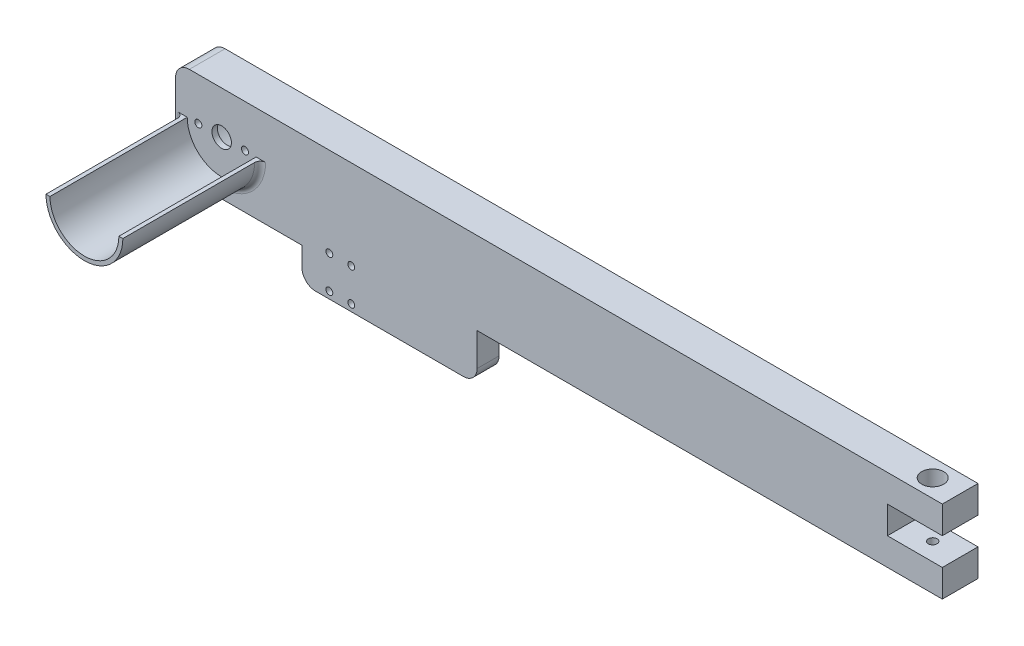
ISO-10303-21;
HEADER;
FILE_DESCRIPTION(('STEP AP214'),'2;1');
FILE_NAME('part.step','',(''),(''),'','','');
FILE_SCHEMA(('AUTOMOTIVE_DESIGN { 1 0 10303 214 1 1 1 1 }'));
ENDSEC;
DATA;
#1=APPLICATION_CONTEXT('core data for automotive mechanical design processes');
#2=APPLICATION_PROTOCOL_DEFINITION('international standard','automotive_design',2000,#1);
#3=PRODUCT_CONTEXT('',#1,'mechanical');
#4=PRODUCT('Part','Part','',(#3));
#5=PRODUCT_RELATED_PRODUCT_CATEGORY('part','',(#4));
#6=PRODUCT_DEFINITION_FORMATION('','',#4);
#7=PRODUCT_DEFINITION_CONTEXT('part definition',#1,'design');
#8=PRODUCT_DEFINITION('design','',#6,#7);
#9=PRODUCT_DEFINITION_SHAPE('','',#8);
#10=(LENGTH_UNIT() NAMED_UNIT(*) SI_UNIT(.MILLI.,.METRE.));
#11=(NAMED_UNIT(*) PLANE_ANGLE_UNIT() SI_UNIT($,.RADIAN.));
#12=(NAMED_UNIT(*) SI_UNIT($,.STERADIAN.) SOLID_ANGLE_UNIT());
#13=UNCERTAINTY_MEASURE_WITH_UNIT(LENGTH_MEASURE(1.E-05),#10,'distance_accuracy_value','');
#14=(GEOMETRIC_REPRESENTATION_CONTEXT(3) GLOBAL_UNCERTAINTY_ASSIGNED_CONTEXT((#13)) GLOBAL_UNIT_ASSIGNED_CONTEXT((#10,
#11,#12)) REPRESENTATION_CONTEXT('',''));
#15=CARTESIAN_POINT('',(0.,0.,0.));
#16=DIRECTION('',(0.,0.,1.));
#17=DIRECTION('',(1.,0.,0.));
#18=AXIS2_PLACEMENT_3D('',#15,#16,#17);
#19=CARTESIAN_POINT('',(245.,15.,-36.7695526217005));
#20=DIRECTION('',(0.,0.,1.));
#21=DIRECTION('',(1.,0.,0.));
#22=AXIS2_PLACEMENT_3D('',#19,#20,#21);
#23=CYLINDRICAL_SURFACE('',#22,12.75);
#24=CARTESIAN_POINT('',(245.,15.,0.));
#25=DIRECTION('',(0.,0.,1.));
#26=DIRECTION('',(1.,0.,0.));
#27=AXIS2_PLACEMENT_3D('',#24,#25,#26);
#28=CIRCLE('',#27,12.75);
#29=CARTESIAN_POINT('',(257.75,15.,0.));
#30=VERTEX_POINT('',#29);
#31=EDGE_CURVE('E348',#30,#30,#28,.F.);
#32=CARTESIAN_POINT('',(245.,15.,8.1));
#33=DIRECTION('',(0.,0.,1.));
#34=DIRECTION('',(1.,0.,0.));
#35=AXIS2_PLACEMENT_3D('',#32,#33,#34);
#36=CIRCLE('',#35,12.75);
#37=CARTESIAN_POINT('',(257.75,15.,8.09999999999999));
#38=VERTEX_POINT('',#37);
#39=EDGE_CURVE('E11',#38,#38,#36,.F.);
#40=CARTESIAN_POINT('',(257.75,15.,0.));
#41=CARTESIAN_POINT('',(257.75,15.,0.0843749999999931));
#42=CARTESIAN_POINT('',(257.75,15.,0.168749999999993));
#43=CARTESIAN_POINT('',(257.75,15.,0.337499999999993));
#44=CARTESIAN_POINT('',(257.75,15.,0.421874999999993));
#45=CARTESIAN_POINT('',(257.75,15.,0.590624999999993));
#46=CARTESIAN_POINT('',(257.75,15.,0.674999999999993));
#47=CARTESIAN_POINT('',(257.75,15.,0.843749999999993));
#48=CARTESIAN_POINT('',(257.75,15.,0.928124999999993));
#49=CARTESIAN_POINT('',(257.75,15.,1.09687499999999));
#50=CARTESIAN_POINT('',(257.75,15.,1.18124999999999));
#51=CARTESIAN_POINT('',(257.75,15.,1.34999999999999));
#52=CARTESIAN_POINT('',(257.75,15.,1.43437499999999));
#53=CARTESIAN_POINT('',(257.75,15.,1.60312499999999));
#54=CARTESIAN_POINT('',(257.75,15.,1.68749999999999));
#55=CARTESIAN_POINT('',(257.75,15.,1.85624999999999));
#56=CARTESIAN_POINT('',(257.75,15.,1.94062499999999));
#57=CARTESIAN_POINT('',(257.75,15.,2.10937499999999));
#58=CARTESIAN_POINT('',(257.75,15.,2.19374999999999));
#59=CARTESIAN_POINT('',(257.75,15.,2.36249999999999));
#60=CARTESIAN_POINT('',(257.75,15.,2.44687499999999));
#61=CARTESIAN_POINT('',(257.75,15.,2.61562499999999));
#62=CARTESIAN_POINT('',(257.75,15.,2.69999999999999));
#63=CARTESIAN_POINT('',(257.75,15.,2.86874999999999));
#64=CARTESIAN_POINT('',(257.75,15.,2.95312499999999));
#65=CARTESIAN_POINT('',(257.75,15.,3.12187499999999));
#66=CARTESIAN_POINT('',(257.75,15.,3.20624999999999));
#67=CARTESIAN_POINT('',(257.75,15.,3.37499999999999));
#68=CARTESIAN_POINT('',(257.75,15.,3.45937499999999));
#69=CARTESIAN_POINT('',(257.75,15.,3.62812499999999));
#70=CARTESIAN_POINT('',(257.75,15.,3.71249999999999));
#71=CARTESIAN_POINT('',(257.75,15.,3.88124999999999));
#72=CARTESIAN_POINT('',(257.75,15.,3.96562499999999));
#73=CARTESIAN_POINT('',(257.75,15.,4.13437499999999));
#74=CARTESIAN_POINT('',(257.75,15.,4.21874999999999));
#75=CARTESIAN_POINT('',(257.75,15.,4.38749999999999));
#76=CARTESIAN_POINT('',(257.75,15.,4.47187499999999));
#77=CARTESIAN_POINT('',(257.75,15.,4.64062499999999));
#78=CARTESIAN_POINT('',(257.75,15.,4.72499999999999));
#79=CARTESIAN_POINT('',(257.75,15.,4.89374999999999));
#80=CARTESIAN_POINT('',(257.75,15.,4.97812499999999));
#81=CARTESIAN_POINT('',(257.75,15.,5.14687499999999));
#82=CARTESIAN_POINT('',(257.75,15.,5.23124999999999));
#83=CARTESIAN_POINT('',(257.75,15.,5.39999999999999));
#84=CARTESIAN_POINT('',(257.75,15.,5.48437499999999));
#85=CARTESIAN_POINT('',(257.75,15.,5.65312499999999));
#86=CARTESIAN_POINT('',(257.75,15.,5.73749999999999));
#87=CARTESIAN_POINT('',(257.75,15.,5.90624999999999));
#88=CARTESIAN_POINT('',(257.75,15.,5.99062499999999));
#89=CARTESIAN_POINT('',(257.75,15.,6.15937499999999));
#90=CARTESIAN_POINT('',(257.75,15.,6.24374999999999));
#91=CARTESIAN_POINT('',(257.75,15.,6.41249999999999));
#92=CARTESIAN_POINT('',(257.75,15.,6.49687499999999));
#93=CARTESIAN_POINT('',(257.75,15.,6.66562499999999));
#94=CARTESIAN_POINT('',(257.75,15.,6.74999999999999));
#95=CARTESIAN_POINT('',(257.75,15.,6.91874999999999));
#96=CARTESIAN_POINT('',(257.75,15.,7.00312499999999));
#97=CARTESIAN_POINT('',(257.75,15.,7.17187499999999));
#98=CARTESIAN_POINT('',(257.75,15.,7.25624999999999));
#99=CARTESIAN_POINT('',(257.75,15.,7.42499999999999));
#100=CARTESIAN_POINT('',(257.75,15.,7.50937499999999));
#101=CARTESIAN_POINT('',(257.75,15.,7.67812499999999));
#102=CARTESIAN_POINT('',(257.75,15.,7.76249999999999));
#103=CARTESIAN_POINT('',(257.75,15.,7.93124999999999));
#104=CARTESIAN_POINT('',(257.75,15.,8.01562499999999));
#105=CARTESIAN_POINT('',(257.75,15.,8.09999999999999));
#106=B_SPLINE_CURVE_WITH_KNOTS('',3,(#40,#41,#42,#43,#44,#45,#46,#47,#48,#49,#50,#51,#52,#53,
#54,#55,#56,#57,#58,#59,#60,#61,#62,#63,#64,#65,#66,#67,#68,#69,#70,#71,#72,#73,#74,#75,#76,#77,
#78,#79,#80,#81,#82,#83,#84,#85,#86,#87,#88,#89,#90,#91,#92,#93,#94,#95,#96,#97,#98,#99,#100,
#101,#102,#103,#104,#105),.UNSPECIFIED.,.F.,.F.,(4,2,2,2,2,2,2,2,2,2,2,2,2,2,2,2,2,2,2,2,2,2,2,
2,2,2,2,2,2,2,2,2,4),(0.,0.253125,0.50625,0.759375,1.0125,1.265625,1.51875,1.771875,2.025,
2.278125,2.53125,2.784375,3.0375,3.290625,3.54375,3.796875,4.05,4.303125,4.55625,4.809375,
5.0625,5.315625,5.56875,5.821875,6.075,6.328125,6.58125,6.834375,7.0875,7.340625,7.59375,
7.846875,8.1),.UNSPECIFIED.);
#107=EDGE_CURVE('BSEAM43',#30,#38,#106,.T.);
#108=ORIENTED_EDGE('',*,*,#31,.T.);
#109=ORIENTED_EDGE('',*,*,#39,.F.);
#110=ORIENTED_EDGE('',*,*,#107,.T.);
#111=ORIENTED_EDGE('',*,*,#107,.F.);
#112=EDGE_LOOP('',(#108,#110,#109,#111));
#113=FACE_BOUND('',#112,.T.);
#114=ADVANCED_FACE('F43',(#113),#23,.F.);
#115=CARTESIAN_POINT('',(165.,15.,-36.7695526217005));
#116=DIRECTION('',(0.,0.,1.));
#117=DIRECTION('',(1.,0.,0.));
#118=AXIS2_PLACEMENT_3D('',#115,#116,#117);
#119=CYLINDRICAL_SURFACE('',#118,12.75);
#120=CARTESIAN_POINT('',(165.,15.,0.));
#121=DIRECTION('',(0.,0.,1.));
#122=DIRECTION('',(1.,0.,0.));
#123=AXIS2_PLACEMENT_3D('',#120,#121,#122);
#124=CIRCLE('',#123,12.75);
#125=CARTESIAN_POINT('',(177.75,15.,0.));
#126=VERTEX_POINT('',#125);
#127=EDGE_CURVE('E351',#126,#126,#124,.F.);
#128=CARTESIAN_POINT('',(165.,15.,8.1));
#129=DIRECTION('',(0.,0.,1.));
#130=DIRECTION('',(1.,0.,0.));
#131=AXIS2_PLACEMENT_3D('',#128,#129,#130);
#132=CIRCLE('',#131,12.75);
#133=CARTESIAN_POINT('',(177.75,15.,8.09999999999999));
#134=VERTEX_POINT('',#133);
#135=EDGE_CURVE('E51',#134,#134,#132,.F.);
#136=CARTESIAN_POINT('',(177.75,15.,0.));
#137=CARTESIAN_POINT('',(177.75,15.,0.0843749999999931));
#138=CARTESIAN_POINT('',(177.75,15.,0.168749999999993));
#139=CARTESIAN_POINT('',(177.75,15.,0.337499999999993));
#140=CARTESIAN_POINT('',(177.75,15.,0.421874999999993));
#141=CARTESIAN_POINT('',(177.75,15.,0.590624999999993));
#142=CARTESIAN_POINT('',(177.75,15.,0.674999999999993));
#143=CARTESIAN_POINT('',(177.75,15.,0.843749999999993));
#144=CARTESIAN_POINT('',(177.75,15.,0.928124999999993));
#145=CARTESIAN_POINT('',(177.75,15.,1.09687499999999));
#146=CARTESIAN_POINT('',(177.75,15.,1.18124999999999));
#147=CARTESIAN_POINT('',(177.75,15.,1.34999999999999));
#148=CARTESIAN_POINT('',(177.75,15.,1.43437499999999));
#149=CARTESIAN_POINT('',(177.75,15.,1.60312499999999));
#150=CARTESIAN_POINT('',(177.75,15.,1.68749999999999));
#151=CARTESIAN_POINT('',(177.75,15.,1.85624999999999));
#152=CARTESIAN_POINT('',(177.75,15.,1.94062499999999));
#153=CARTESIAN_POINT('',(177.75,15.,2.10937499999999));
#154=CARTESIAN_POINT('',(177.75,15.,2.19374999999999));
#155=CARTESIAN_POINT('',(177.75,15.,2.36249999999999));
#156=CARTESIAN_POINT('',(177.75,15.,2.44687499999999));
#157=CARTESIAN_POINT('',(177.75,15.,2.61562499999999));
#158=CARTESIAN_POINT('',(177.75,15.,2.69999999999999));
#159=CARTESIAN_POINT('',(177.75,15.,2.86874999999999));
#160=CARTESIAN_POINT('',(177.75,15.,2.95312499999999));
#161=CARTESIAN_POINT('',(177.75,15.,3.12187499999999));
#162=CARTESIAN_POINT('',(177.75,15.,3.20624999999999));
#163=CARTESIAN_POINT('',(177.75,15.,3.37499999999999));
#164=CARTESIAN_POINT('',(177.75,15.,3.45937499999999));
#165=CARTESIAN_POINT('',(177.75,15.,3.62812499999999));
#166=CARTESIAN_POINT('',(177.75,15.,3.71249999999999));
#167=CARTESIAN_POINT('',(177.75,15.,3.88124999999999));
#168=CARTESIAN_POINT('',(177.75,15.,3.96562499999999));
#169=CARTESIAN_POINT('',(177.75,15.,4.13437499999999));
#170=CARTESIAN_POINT('',(177.75,15.,4.21874999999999));
#171=CARTESIAN_POINT('',(177.75,15.,4.38749999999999));
#172=CARTESIAN_POINT('',(177.75,15.,4.47187499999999));
#173=CARTESIAN_POINT('',(177.75,15.,4.64062499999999));
#174=CARTESIAN_POINT('',(177.75,15.,4.72499999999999));
#175=CARTESIAN_POINT('',(177.75,15.,4.89374999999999));
#176=CARTESIAN_POINT('',(177.75,15.,4.97812499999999));
#177=CARTESIAN_POINT('',(177.75,15.,5.14687499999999));
#178=CARTESIAN_POINT('',(177.75,15.,5.23124999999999));
#179=CARTESIAN_POINT('',(177.75,15.,5.39999999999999));
#180=CARTESIAN_POINT('',(177.75,15.,5.48437499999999));
#181=CARTESIAN_POINT('',(177.75,15.,5.65312499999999));
#182=CARTESIAN_POINT('',(177.75,15.,5.73749999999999));
#183=CARTESIAN_POINT('',(177.75,15.,5.90624999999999));
#184=CARTESIAN_POINT('',(177.75,15.,5.99062499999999));
#185=CARTESIAN_POINT('',(177.75,15.,6.15937499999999));
#186=CARTESIAN_POINT('',(177.75,15.,6.24374999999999));
#187=CARTESIAN_POINT('',(177.75,15.,6.41249999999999));
#188=CARTESIAN_POINT('',(177.75,15.,6.49687499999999));
#189=CARTESIAN_POINT('',(177.75,15.,6.66562499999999));
#190=CARTESIAN_POINT('',(177.75,15.,6.74999999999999));
#191=CARTESIAN_POINT('',(177.75,15.,6.91874999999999));
#192=CARTESIAN_POINT('',(177.75,15.,7.00312499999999));
#193=CARTESIAN_POINT('',(177.75,15.,7.17187499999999));
#194=CARTESIAN_POINT('',(177.75,15.,7.25624999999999));
#195=CARTESIAN_POINT('',(177.75,15.,7.42499999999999));
#196=CARTESIAN_POINT('',(177.75,15.,7.50937499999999));
#197=CARTESIAN_POINT('',(177.75,15.,7.67812499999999));
#198=CARTESIAN_POINT('',(177.75,15.,7.76249999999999));
#199=CARTESIAN_POINT('',(177.75,15.,7.93124999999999));
#200=CARTESIAN_POINT('',(177.75,15.,8.01562499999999));
#201=CARTESIAN_POINT('',(177.75,15.,8.09999999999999));
#202=B_SPLINE_CURVE_WITH_KNOTS('',3,(#136,#137,#138,#139,#140,#141,#142,#143,#144,#145,#146,
#147,#148,#149,#150,#151,#152,#153,#154,#155,#156,#157,#158,#159,#160,#161,#162,#163,#164,#165,
#166,#167,#168,#169,#170,#171,#172,#173,#174,#175,#176,#177,#178,#179,#180,#181,#182,#183,#184,
#185,#186,#187,#188,#189,#190,#191,#192,#193,#194,#195,#196,#197,#198,#199,#200,#201),
.UNSPECIFIED.,.F.,.F.,(4,2,2,2,2,2,2,2,2,2,2,2,2,2,2,2,2,2,2,2,2,2,2,2,2,2,2,2,2,2,2,2,4),(0.,
0.253125,0.50625,0.759375,1.0125,1.265625,1.51875,1.771875,2.025,2.278125,2.53125,2.784375,
3.0375,3.290625,3.54375,3.796875,4.05,4.303125,4.55625,4.809375,5.0625,5.315625,5.56875,
5.821875,6.075,6.328125,6.58125,6.834375,7.0875,7.340625,7.59375,7.846875,8.1),.UNSPECIFIED.);
#203=EDGE_CURVE('BSEAM431',#126,#134,#202,.T.);
#204=ORIENTED_EDGE('',*,*,#127,.T.);
#205=ORIENTED_EDGE('',*,*,#135,.F.);
#206=ORIENTED_EDGE('',*,*,#203,.T.);
#207=ORIENTED_EDGE('',*,*,#203,.F.);
#208=EDGE_LOOP('',(#204,#206,#205,#207));
#209=FACE_BOUND('',#208,.T.);
#210=ADVANCED_FACE('F431',(#209),#119,.F.);
#211=CARTESIAN_POINT('',(85.,15.,-36.7695526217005));
#212=DIRECTION('',(0.,0.,1.));
#213=DIRECTION('',(1.,0.,0.));
#214=AXIS2_PLACEMENT_3D('',#211,#212,#213);
#215=CYLINDRICAL_SURFACE('',#214,12.75);
#216=CARTESIAN_POINT('',(85.,15.,0.));
#217=DIRECTION('',(0.,0.,1.));
#218=DIRECTION('',(1.,0.,0.));
#219=AXIS2_PLACEMENT_3D('',#216,#217,#218);
#220=CIRCLE('',#219,12.75);
#221=CARTESIAN_POINT('',(97.75,15.,0.));
#222=VERTEX_POINT('',#221);
#223=EDGE_CURVE('E354',#222,#222,#220,.F.);
#224=CARTESIAN_POINT('',(85.,15.,8.1));
#225=DIRECTION('',(0.,0.,1.));
#226=DIRECTION('',(1.,0.,0.));
#227=AXIS2_PLACEMENT_3D('',#224,#225,#226);
#228=CIRCLE('',#227,12.75);
#229=CARTESIAN_POINT('',(97.75,15.,8.09999999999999));
#230=VERTEX_POINT('',#229);
#231=EDGE_CURVE('E423',#230,#230,#228,.F.);
#232=CARTESIAN_POINT('',(97.75,15.,0.));
#233=CARTESIAN_POINT('',(97.75,15.,0.0843749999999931));
#234=CARTESIAN_POINT('',(97.75,15.,0.168749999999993));
#235=CARTESIAN_POINT('',(97.75,15.,0.337499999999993));
#236=CARTESIAN_POINT('',(97.75,15.,0.421874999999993));
#237=CARTESIAN_POINT('',(97.75,15.,0.590624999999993));
#238=CARTESIAN_POINT('',(97.75,15.,0.674999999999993));
#239=CARTESIAN_POINT('',(97.75,15.,0.843749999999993));
#240=CARTESIAN_POINT('',(97.75,15.,0.928124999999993));
#241=CARTESIAN_POINT('',(97.75,15.,1.09687499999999));
#242=CARTESIAN_POINT('',(97.75,15.,1.18124999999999));
#243=CARTESIAN_POINT('',(97.75,15.,1.34999999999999));
#244=CARTESIAN_POINT('',(97.75,15.,1.43437499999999));
#245=CARTESIAN_POINT('',(97.75,15.,1.60312499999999));
#246=CARTESIAN_POINT('',(97.75,15.,1.68749999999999));
#247=CARTESIAN_POINT('',(97.75,15.,1.85624999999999));
#248=CARTESIAN_POINT('',(97.75,15.,1.94062499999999));
#249=CARTESIAN_POINT('',(97.75,15.,2.10937499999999));
#250=CARTESIAN_POINT('',(97.75,15.,2.19374999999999));
#251=CARTESIAN_POINT('',(97.75,15.,2.36249999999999));
#252=CARTESIAN_POINT('',(97.75,15.,2.44687499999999));
#253=CARTESIAN_POINT('',(97.75,15.,2.61562499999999));
#254=CARTESIAN_POINT('',(97.75,15.,2.69999999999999));
#255=CARTESIAN_POINT('',(97.75,15.,2.86874999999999));
#256=CARTESIAN_POINT('',(97.75,15.,2.95312499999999));
#257=CARTESIAN_POINT('',(97.75,15.,3.12187499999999));
#258=CARTESIAN_POINT('',(97.75,15.,3.20624999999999));
#259=CARTESIAN_POINT('',(97.75,15.,3.37499999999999));
#260=CARTESIAN_POINT('',(97.75,15.,3.45937499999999));
#261=CARTESIAN_POINT('',(97.75,15.,3.62812499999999));
#262=CARTESIAN_POINT('',(97.75,15.,3.71249999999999));
#263=CARTESIAN_POINT('',(97.75,15.,3.88124999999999));
#264=CARTESIAN_POINT('',(97.75,15.,3.96562499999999));
#265=CARTESIAN_POINT('',(97.75,15.,4.13437499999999));
#266=CARTESIAN_POINT('',(97.75,15.,4.21874999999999));
#267=CARTESIAN_POINT('',(97.75,15.,4.38749999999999));
#268=CARTESIAN_POINT('',(97.75,15.,4.47187499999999));
#269=CARTESIAN_POINT('',(97.75,15.,4.64062499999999));
#270=CARTESIAN_POINT('',(97.75,15.,4.72499999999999));
#271=CARTESIAN_POINT('',(97.75,15.,4.89374999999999));
#272=CARTESIAN_POINT('',(97.75,15.,4.97812499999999));
#273=CARTESIAN_POINT('',(97.75,15.,5.14687499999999));
#274=CARTESIAN_POINT('',(97.75,15.,5.23124999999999));
#275=CARTESIAN_POINT('',(97.75,15.,5.39999999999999));
#276=CARTESIAN_POINT('',(97.75,15.,5.48437499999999));
#277=CARTESIAN_POINT('',(97.75,15.,5.65312499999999));
#278=CARTESIAN_POINT('',(97.75,15.,5.73749999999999));
#279=CARTESIAN_POINT('',(97.75,15.,5.90624999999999));
#280=CARTESIAN_POINT('',(97.75,15.,5.99062499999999));
#281=CARTESIAN_POINT('',(97.75,15.,6.15937499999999));
#282=CARTESIAN_POINT('',(97.75,15.,6.24374999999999));
#283=CARTESIAN_POINT('',(97.75,15.,6.41249999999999));
#284=CARTESIAN_POINT('',(97.75,15.,6.49687499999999));
#285=CARTESIAN_POINT('',(97.75,15.,6.66562499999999));
#286=CARTESIAN_POINT('',(97.75,15.,6.74999999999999));
#287=CARTESIAN_POINT('',(97.75,15.,6.91874999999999));
#288=CARTESIAN_POINT('',(97.75,15.,7.00312499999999));
#289=CARTESIAN_POINT('',(97.75,15.,7.17187499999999));
#290=CARTESIAN_POINT('',(97.75,15.,7.25624999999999));
#291=CARTESIAN_POINT('',(97.75,15.,7.42499999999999));
#292=CARTESIAN_POINT('',(97.75,15.,7.50937499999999));
#293=CARTESIAN_POINT('',(97.75,15.,7.67812499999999));
#294=CARTESIAN_POINT('',(97.75,15.,7.76249999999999));
#295=CARTESIAN_POINT('',(97.75,15.,7.93124999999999));
#296=CARTESIAN_POINT('',(97.75,15.,8.01562499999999));
#297=CARTESIAN_POINT('',(97.75,15.,8.09999999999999));
#298=B_SPLINE_CURVE_WITH_KNOTS('',3,(#232,#233,#234,#235,#236,#237,#238,#239,#240,#241,#242,
#243,#244,#245,#246,#247,#248,#249,#250,#251,#252,#253,#254,#255,#256,#257,#258,#259,#260,#261,
#262,#263,#264,#265,#266,#267,#268,#269,#270,#271,#272,#273,#274,#275,#276,#277,#278,#279,#280,
#281,#282,#283,#284,#285,#286,#287,#288,#289,#290,#291,#292,#293,#294,#295,#296,#297),
.UNSPECIFIED.,.F.,.F.,(4,2,2,2,2,2,2,2,2,2,2,2,2,2,2,2,2,2,2,2,2,2,2,2,2,2,2,2,2,2,2,2,4),(0.,
0.253125,0.50625,0.759375,1.0125,1.265625,1.51875,1.771875,2.025,2.278125,2.53125,2.784375,
3.0375,3.290625,3.54375,3.796875,4.05,4.303125,4.55625,4.809375,5.0625,5.315625,5.56875,
5.821875,6.075,6.328125,6.58125,6.834375,7.0875,7.340625,7.59375,7.846875,8.1),.UNSPECIFIED.);
#299=EDGE_CURVE('BSEAM433',#222,#230,#298,.T.);
#300=ORIENTED_EDGE('',*,*,#223,.T.);
#301=ORIENTED_EDGE('',*,*,#231,.F.);
#302=ORIENTED_EDGE('',*,*,#299,.T.);
#303=ORIENTED_EDGE('',*,*,#299,.F.);
#304=EDGE_LOOP('',(#300,#302,#301,#303));
#305=FACE_BOUND('',#304,.T.);
#306=ADVANCED_FACE('F433',(#305),#215,.F.);
#307=CARTESIAN_POINT('',(20.775,14.5,11.));
#308=DIRECTION('',(0.,0.,1.));
#309=DIRECTION('',(1.,0.,0.));
#310=AXIS2_PLACEMENT_3D('',#307,#308,#309);
#311=PLANE('',#310);
#312=CARTESIAN_POINT('',(12.275,14.5,11.));
#313=DIRECTION('',(0.,0.,-1.));
#314=DIRECTION('',(-1.,0.,0.));
#315=AXIS2_PLACEMENT_3D('',#312,#313,#314);
#316=CIRCLE('',#315,1.275);
#317=CARTESIAN_POINT('',(11.,14.5,11.));
#318=VERTEX_POINT('',#317);
#319=EDGE_CURVE('E602',#318,#318,#316,.T.);
#320=ORIENTED_EDGE('',*,*,#319,.F.);
#321=EDGE_LOOP('',(#320));
#322=FACE_BOUND('',#321,.T.);
#323=CARTESIAN_POINT('',(29.275,14.5,11.));
#324=DIRECTION('',(0.,0.,-1.));
#325=DIRECTION('',(-1.,0.,0.));
#326=AXIS2_PLACEMENT_3D('',#323,#324,#325);
#327=CIRCLE('',#326,1.275);
#328=CARTESIAN_POINT('',(28.,14.5,11.));
#329=VERTEX_POINT('',#328);
#330=EDGE_CURVE('E599',#329,#329,#327,.T.);
#331=ORIENTED_EDGE('',*,*,#330,.F.);
#332=EDGE_LOOP('',(#331));
#333=FACE_BOUND('',#332,.T.);
#334=CARTESIAN_POINT('',(20.775,14.5,11.));
#335=DIRECTION('',(0.,0.,1.));
#336=DIRECTION('',(1.,0.,0.));
#337=AXIS2_PLACEMENT_3D('',#334,#335,#336);
#338=CIRCLE('',#337,13.25);
#339=CARTESIAN_POINT('',(34.025,14.5,11.));
#340=VERTEX_POINT('',#339);
#341=EDGE_CURVE('E421',#340,#340,#338,.F.);
#342=ORIENTED_EDGE('',*,*,#341,.T.);
#343=EDGE_LOOP('',(#342));
#344=FACE_BOUND('',#343,.T.);
#345=CARTESIAN_POINT('',(20.775,14.5,11.));
#346=DIRECTION('',(0.,0.,-1.));
#347=DIRECTION('',(-1.,0.,0.));
#348=AXIS2_PLACEMENT_3D('',#345,#346,#347);
#349=CIRCLE('',#348,3.55);
#350=CARTESIAN_POINT('',(17.225,14.5,11.));
#351=VERTEX_POINT('',#350);
#352=EDGE_CURVE('E597',#351,#351,#349,.T.);
#353=ORIENTED_EDGE('',*,*,#352,.F.);
#354=EDGE_LOOP('',(#353));
#355=FACE_BOUND('',#354,.T.);
#356=ADVANCED_FACE('F440',(#322,#333,#344,#355),#311,.F.);
#357=CARTESIAN_POINT('',(20.775,14.5,0.));
#358=DIRECTION('',(0.,0.,1.));
#359=DIRECTION('',(1.,0.,0.));
#360=AXIS2_PLACEMENT_3D('',#357,#358,#359);
#361=CYLINDRICAL_SURFACE('',#360,13.25);
#362=CARTESIAN_POINT('',(20.775,14.5,0.));
#363=DIRECTION('',(0.,0.,1.));
#364=DIRECTION('',(1.,0.,0.));
#365=AXIS2_PLACEMENT_3D('',#362,#363,#364);
#366=CIRCLE('',#365,13.25);
#367=CARTESIAN_POINT('',(34.025,14.5,0.));
#368=VERTEX_POINT('',#367);
#369=EDGE_CURVE('E342',#368,#368,#366,.T.);
#370=ORIENTED_EDGE('',*,*,#369,.F.);
#371=EDGE_LOOP('',(#370));
#372=FACE_BOUND('',#371,.T.);
#373=ORIENTED_EDGE('',*,*,#341,.F.);
#374=EDGE_LOOP('',(#373));
#375=FACE_BOUND('',#374,.T.);
#376=ADVANCED_FACE('F456',(#372,#375),#361,.F.);
#377=CARTESIAN_POINT('',(0.,0.,13.));
#378=DIRECTION('',(0.,0.,1.));
#379=DIRECTION('',(1.,0.,0.));
#380=AXIS2_PLACEMENT_3D('',#377,#378,#379);
#381=PLANE('',#380);
#382=CARTESIAN_POINT('',(12.275,14.5,13.));
#383=DIRECTION('',(0.,0.,1.));
#384=DIRECTION('',(1.,0.,0.));
#385=AXIS2_PLACEMENT_3D('',#382,#383,#384);
#386=CIRCLE('',#385,1.275);
#387=CARTESIAN_POINT('',(13.55,14.5,13.));
#388=VERTEX_POINT('',#387);
#389=EDGE_CURVE('E213',#388,#388,#386,.T.);
#390=ORIENTED_EDGE('',*,*,#389,.F.);
#391=EDGE_LOOP('',(#390));
#392=FACE_BOUND('',#391,.T.);
#393=CARTESIAN_POINT('',(29.275,14.5,13.));
#394=DIRECTION('',(0.,0.,1.));
#395=DIRECTION('',(1.,0.,0.));
#396=AXIS2_PLACEMENT_3D('',#393,#394,#395);
#397=CIRCLE('',#396,1.275);
#398=CARTESIAN_POINT('',(30.55,14.5,13.));
#399=VERTEX_POINT('',#398);
#400=EDGE_CURVE('E606',#399,#399,#397,.T.);
#401=ORIENTED_EDGE('',*,*,#400,.F.);
#402=EDGE_LOOP('',(#401));
#403=FACE_BOUND('',#402,.T.);
#404=CARTESIAN_POINT('',(20.775,14.5,13.));
#405=DIRECTION('',(0.,0.,1.));
#406=DIRECTION('',(1.,0.,0.));
#407=AXIS2_PLACEMENT_3D('',#404,#405,#406);
#408=CIRCLE('',#407,3.55);
#409=CARTESIAN_POINT('',(24.325,14.5,13.));
#410=VERTEX_POINT('',#409);
#411=EDGE_CURVE('E208',#410,#410,#408,.T.);
#412=ORIENTED_EDGE('',*,*,#411,.F.);
#413=EDGE_LOOP('',(#412));
#414=FACE_BOUND('',#413,.T.);
#415=DIRECTION('',(1.,0.,0.));
#416=VECTOR('',#415,1.);
#417=CARTESIAN_POINT('',(0.,30.,13.));
#418=LINE('',#417,#416);
#419=CARTESIAN_POINT('',(9.,30.,13.));
#420=VERTEX_POINT('',#419);
#421=CARTESIAN_POINT('',(283.325,30.,13.));
#422=VERTEX_POINT('',#421);
#423=EDGE_CURVE('E370',#420,#422,#418,.T.);
#424=ORIENTED_EDGE('',*,*,#423,.F.);
#425=CARTESIAN_POINT('',(9.,25.,13.));
#426=DIRECTION('',(0.,0.,1.));
#427=DIRECTION('',(1.,0.,0.));
#428=AXIS2_PLACEMENT_3D('',#425,#426,#427);
#429=CIRCLE('',#428,5.);
#430=CARTESIAN_POINT('',(4.,25.,13.));
#431=VERTEX_POINT('',#430);
#432=EDGE_CURVE('E379',#420,#431,#429,.T.);
#433=ORIENTED_EDGE('',*,*,#432,.T.);
#434=DIRECTION('',(0.,1.,0.));
#435=VECTOR('',#434,1.);
#436=CARTESIAN_POINT('',(4.,30.,13.));
#437=LINE('',#436,#435);
#438=CARTESIAN_POINT('',(4.,0.,13.));
#439=VERTEX_POINT('',#438);
#440=EDGE_CURVE('E360',#439,#431,#437,.T.);
#441=ORIENTED_EDGE('',*,*,#440,.F.);
#442=CARTESIAN_POINT('',(9.,0.,13.));
#443=DIRECTION('',(0.,0.,1.));
#444=DIRECTION('',(1.,0.,0.));
#445=AXIS2_PLACEMENT_3D('',#442,#443,#444);
#446=CIRCLE('',#445,5.);
#447=CARTESIAN_POINT('',(9.,-5.,13.));
#448=VERTEX_POINT('',#447);
#449=EDGE_CURVE('E392',#439,#448,#446,.T.);
#450=ORIENTED_EDGE('',*,*,#449,.T.);
#451=DIRECTION('',(1.,0.,0.));
#452=VECTOR('',#451,1.);
#453=CARTESIAN_POINT('',(0.,-5.,13.));
#454=LINE('',#453,#452);
#455=CARTESIAN_POINT('',(50.005,-5.,13.));
#456=VERTEX_POINT('',#455);
#457=EDGE_CURVE('E364',#448,#456,#454,.T.);
#458=ORIENTED_EDGE('',*,*,#457,.T.);
#459=DIRECTION('',(0.,-1.,0.));
#460=VECTOR('',#459,1.);
#461=CARTESIAN_POINT('',(50.005,0.,13.));
#462=LINE('',#461,#460);
#463=CARTESIAN_POINT('',(50.005,-12.,13.));
#464=VERTEX_POINT('',#463);
#465=EDGE_CURVE('E332',#456,#464,#462,.T.);
#466=ORIENTED_EDGE('',*,*,#465,.T.);
#467=CARTESIAN_POINT('',(55.005,-12.,13.));
#468=DIRECTION('',(0.,0.,1.));
#469=DIRECTION('',(1.,0.,0.));
#470=AXIS2_PLACEMENT_3D('',#467,#468,#469);
#471=CIRCLE('',#470,5.);
#472=CARTESIAN_POINT('',(55.005,-17.,13.));
#473=VERTEX_POINT('',#472);
#474=EDGE_CURVE('E399',#464,#473,#471,.T.);
#475=ORIENTED_EDGE('',*,*,#474,.T.);
#476=DIRECTION('',(1.,0.,0.));
#477=VECTOR('',#476,1.);
#478=CARTESIAN_POINT('',(0.,-17.,13.));
#479=LINE('',#478,#477);
#480=CARTESIAN_POINT('',(108.83125,-17.,13.));
#481=VERTEX_POINT('',#480);
#482=EDGE_CURVE('E335',#473,#481,#479,.T.);
#483=ORIENTED_EDGE('',*,*,#482,.T.);
#484=CARTESIAN_POINT('',(108.83125,-12.,13.));
#485=DIRECTION('',(0.,0.,1.));
#486=DIRECTION('',(1.,0.,0.));
#487=AXIS2_PLACEMENT_3D('',#484,#485,#486);
#488=CIRCLE('',#487,5.);
#489=CARTESIAN_POINT('',(113.83125,-12.0000028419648,13.));
#490=VERTEX_POINT('',#489);
#491=EDGE_CURVE('E396',#481,#490,#488,.T.);
#492=ORIENTED_EDGE('',*,*,#491,.T.);
#493=DIRECTION('',(0.,-1.,0.));
#494=VECTOR('',#493,1.);
#495=CARTESIAN_POINT('',(113.83125,0.,13.));
#496=LINE('',#495,#494);
#497=CARTESIAN_POINT('',(113.83125,0.,13.));
#498=VERTEX_POINT('',#497);
#499=EDGE_CURVE('E317',#498,#490,#496,.T.);
#500=ORIENTED_EDGE('',*,*,#499,.F.);
#501=DIRECTION('',(1.,0.,0.));
#502=VECTOR('',#501,1.);
#503=CARTESIAN_POINT('',(0.,0.,13.));
#504=LINE('',#503,#502);
#505=CARTESIAN_POINT('',(283.325,0.,13.));
#506=VERTEX_POINT('',#505);
#507=EDGE_CURVE('E366',#498,#506,#504,.T.);
#508=ORIENTED_EDGE('',*,*,#507,.T.);
#509=DIRECTION('',(0.,1.,0.));
#510=VECTOR('',#509,1.);
#511=CARTESIAN_POINT('',(283.325,0.,13.));
#512=LINE('',#511,#510);
#513=CARTESIAN_POINT('',(283.325,10.,13.));
#514=VERTEX_POINT('',#513);
#515=EDGE_CURVE('E314',#506,#514,#512,.T.);
#516=ORIENTED_EDGE('',*,*,#515,.T.);
#517=DIRECTION('',(-1.,0.,0.));
#518=VECTOR('',#517,1.);
#519=CARTESIAN_POINT('',(0.,10.,13.));
#520=LINE('',#519,#518);
#521=CARTESIAN_POINT('',(263.325,10.,13.));
#522=VERTEX_POINT('',#521);
#523=EDGE_CURVE('E305',#514,#522,#520,.T.);
#524=ORIENTED_EDGE('',*,*,#523,.T.);
#525=DIRECTION('',(0.,1.,0.));
#526=VECTOR('',#525,1.);
#527=CARTESIAN_POINT('',(263.325,0.,13.));
#528=LINE('',#527,#526);
#529=CARTESIAN_POINT('',(263.325,20.,13.));
#530=VERTEX_POINT('',#529);
#531=EDGE_CURVE('E308',#522,#530,#528,.T.);
#532=ORIENTED_EDGE('',*,*,#531,.T.);
#533=DIRECTION('',(1.,0.,0.));
#534=VECTOR('',#533,1.);
#535=CARTESIAN_POINT('',(0.,20.,13.));
#536=LINE('',#535,#534);
#537=CARTESIAN_POINT('',(283.325,20.,13.));
#538=VERTEX_POINT('',#537);
#539=EDGE_CURVE('E311',#530,#538,#536,.T.);
#540=ORIENTED_EDGE('',*,*,#539,.T.);
#541=DIRECTION('',(0.,1.,0.));
#542=VECTOR('',#541,1.);
#543=CARTESIAN_POINT('',(283.325,0.,13.));
#544=LINE('',#543,#542);
#545=EDGE_CURVE('E292',#538,#422,#544,.T.);
#546=ORIENTED_EDGE('',*,*,#545,.T.);
#547=EDGE_LOOP('',(#424,#433,#441,#450,#458,#466,#475,#483,#492,#500,#508,#516,#524,#532,#540,#546));
#548=FACE_BOUND('',#547,.T.);
#549=CARTESIAN_POINT('',(60.005,-2.5,13.));
#550=DIRECTION('',(0.,0.,1.));
#551=DIRECTION('',(1.,0.,0.));
#552=AXIS2_PLACEMENT_3D('',#549,#550,#551);
#553=CIRCLE('',#552,1.25);
#554=CARTESIAN_POINT('',(61.255,-2.5,13.));
#555=VERTEX_POINT('',#554);
#556=EDGE_CURVE('E329',#555,#555,#553,.T.);
#557=ORIENTED_EDGE('',*,*,#556,.F.);
#558=EDGE_LOOP('',(#557));
#559=FACE_BOUND('',#558,.T.);
#560=CARTESIAN_POINT('',(68.005,-2.5,13.));
#561=DIRECTION('',(0.,0.,1.));
#562=DIRECTION('',(1.,0.,0.));
#563=AXIS2_PLACEMENT_3D('',#560,#561,#562);
#564=CIRCLE('',#563,1.24999999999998);
#565=CARTESIAN_POINT('',(69.255,-2.5,13.));
#566=VERTEX_POINT('',#565);
#567=EDGE_CURVE('E326',#566,#566,#564,.T.);
#568=ORIENTED_EDGE('',*,*,#567,.F.);
#569=EDGE_LOOP('',(#568));
#570=FACE_BOUND('',#569,.T.);
#571=CARTESIAN_POINT('',(68.005,-14.5,13.));
#572=DIRECTION('',(0.,0.,1.));
#573=DIRECTION('',(1.,0.,0.));
#574=AXIS2_PLACEMENT_3D('',#571,#572,#573);
#575=CIRCLE('',#574,1.24999999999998);
#576=CARTESIAN_POINT('',(69.255,-14.5,13.));
#577=VERTEX_POINT('',#576);
#578=EDGE_CURVE('E323',#577,#577,#575,.T.);
#579=ORIENTED_EDGE('',*,*,#578,.F.);
#580=EDGE_LOOP('',(#579));
#581=FACE_BOUND('',#580,.T.);
#582=CARTESIAN_POINT('',(60.005,-14.5,13.));
#583=DIRECTION('',(0.,0.,1.));
#584=DIRECTION('',(1.,0.,0.));
#585=AXIS2_PLACEMENT_3D('',#582,#583,#584);
#586=CIRCLE('',#585,1.25);
#587=CARTESIAN_POINT('',(61.255,-14.5,13.));
#588=VERTEX_POINT('',#587);
#589=EDGE_CURVE('E320',#588,#588,#586,.T.);
#590=ORIENTED_EDGE('',*,*,#589,.F.);
#591=EDGE_LOOP('',(#590));
#592=FACE_BOUND('',#591,.T.);
#593=DIRECTION('',(1.,0.,0.));
#594=VECTOR('',#593,1.);
#595=CARTESIAN_POINT('',(0.,14.5,13.));
#596=LINE('',#595,#594);
#597=CARTESIAN_POINT('',(33.325,14.5,13.));
#598=VERTEX_POINT('',#597);
#599=CARTESIAN_POINT('',(36.775,14.5,13.));
#600=VERTEX_POINT('',#599);
#601=EDGE_CURVE('E58',#598,#600,#596,.T.);
#602=ORIENTED_EDGE('',*,*,#601,.T.);
#603=CARTESIAN_POINT('',(20.775,14.5,13.));
#604=DIRECTION('',(0.,0.,1.));
#605=DIRECTION('',(1.,0.,0.));
#606=AXIS2_PLACEMENT_3D('',#603,#604,#605);
#607=CIRCLE('',#606,16.);
#608=CARTESIAN_POINT('',(4.775,14.5,13.));
#609=VERTEX_POINT('',#608);
#610=EDGE_CURVE('E416',#600,#609,#607,.F.);
#611=ORIENTED_EDGE('',*,*,#610,.T.);
#612=DIRECTION('',(-1.,0.,0.));
#613=VECTOR('',#612,1.);
#614=CARTESIAN_POINT('',(0.,14.5,13.));
#615=LINE('',#614,#613);
#616=CARTESIAN_POINT('',(8.225,14.5,13.));
#617=VERTEX_POINT('',#616);
#618=EDGE_CURVE('E66',#617,#609,#615,.T.);
#619=ORIENTED_EDGE('',*,*,#618,.F.);
#620=CARTESIAN_POINT('',(20.775,14.5,13.));
#621=DIRECTION('',(0.,0.,1.));
#622=DIRECTION('',(1.,0.,0.));
#623=AXIS2_PLACEMENT_3D('',#620,#621,#622);
#624=CIRCLE('',#623,12.55);
#625=EDGE_CURVE('E200',#617,#598,#624,.T.);
#626=ORIENTED_EDGE('',*,*,#625,.T.);
#627=EDGE_LOOP('',(#602,#611,#619,#626));
#628=FACE_BOUND('',#627,.T.);
#629=ADVANCED_FACE('F207',(#392,#403,#414,#548,#559,#570,#581,#592,#628),#381,.T.);
#630=CARTESIAN_POINT('',(0.,-5.,13.));
#631=DIRECTION('',(0.,1.,0.));
#632=DIRECTION('',(0.,0.,1.));
#633=AXIS2_PLACEMENT_3D('',#630,#631,#632);
#634=PLANE('',#633);
#635=DIRECTION('',(-1.,0.,0.));
#636=VECTOR('',#635,1.);
#637=CARTESIAN_POINT('',(0.,-5.,5.));
#638=LINE('',#637,#636);
#639=CARTESIAN_POINT('',(50.005,-5.,5.));
#640=VERTEX_POINT('',#639);
#641=CARTESIAN_POINT('',(9.,-5.,5.));
#642=VERTEX_POINT('',#641);
#643=EDGE_CURVE('E239',#640,#642,#638,.T.);
#644=ORIENTED_EDGE('',*,*,#643,.F.);
#645=DIRECTION('',(0.,0.,1.));
#646=VECTOR('',#645,1.);
#647=CARTESIAN_POINT('',(50.005,-5.,-83.1235132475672));
#648=LINE('',#647,#646);
#649=EDGE_CURVE('E339',#640,#456,#648,.T.);
#650=ORIENTED_EDGE('',*,*,#649,.T.);
#651=ORIENTED_EDGE('',*,*,#457,.F.);
#652=DIRECTION('',(0.,0.,-1.));
#653=VECTOR('',#652,1.);
#654=CARTESIAN_POINT('',(9.,-5.,13.));
#655=LINE('',#654,#653);
#656=EDGE_CURVE('E385',#448,#642,#655,.T.);
#657=ORIENTED_EDGE('',*,*,#656,.T.);
#658=EDGE_LOOP('',(#644,#650,#651,#657));
#659=FACE_BOUND('',#658,.T.);
#660=ADVANCED_FACE('F455',(#659),#634,.F.);
#661=CARTESIAN_POINT('',(9.,0.,13.));
#662=DIRECTION('',(0.,0.,1.));
#663=DIRECTION('',(1.,0.,0.));
#664=AXIS2_PLACEMENT_3D('',#661,#662,#663);
#665=CYLINDRICAL_SURFACE('',#664,5.);
#666=DIRECTION('',(0.,0.,-1.));
#667=VECTOR('',#666,1.);
#668=CARTESIAN_POINT('',(4.,0.,13.));
#669=LINE('',#668,#667);
#670=CARTESIAN_POINT('',(4.,0.,5.));
#671=VERTEX_POINT('',#670);
#672=EDGE_CURVE('E388',#671,#439,#669,.F.);
#673=ORIENTED_EDGE('',*,*,#672,.F.);
#674=CARTESIAN_POINT('',(9.,0.,5.));
#675=DIRECTION('',(0.,0.,-1.));
#676=DIRECTION('',(-1.,0.,0.));
#677=AXIS2_PLACEMENT_3D('',#674,#675,#676);
#678=CIRCLE('',#677,5.);
#679=EDGE_CURVE('E241',#671,#642,#678,.F.);
#680=ORIENTED_EDGE('',*,*,#679,.T.);
#681=ORIENTED_EDGE('',*,*,#656,.F.);
#682=ORIENTED_EDGE('',*,*,#449,.F.);
#683=EDGE_LOOP('',(#673,#680,#681,#682));
#684=FACE_BOUND('',#683,.T.);
#685=ADVANCED_FACE('F472',(#684),#665,.T.);
#686=CARTESIAN_POINT('',(60.005,-2.5,-83.1235132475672));
#687=DIRECTION('',(0.,0.,1.));
#688=DIRECTION('',(1.,0.,0.));
#689=AXIS2_PLACEMENT_3D('',#686,#687,#688);
#690=CYLINDRICAL_SURFACE('',#689,1.25);
#691=ORIENTED_EDGE('',*,*,#556,.T.);
#692=EDGE_LOOP('',(#691));
#693=FACE_BOUND('',#692,.T.);
#694=CARTESIAN_POINT('',(60.005,-2.5,5.));
#695=DIRECTION('',(0.,0.,-1.));
#696=DIRECTION('',(-1.,0.,0.));
#697=AXIS2_PLACEMENT_3D('',#694,#695,#696);
#698=CIRCLE('',#697,1.25);
#699=CARTESIAN_POINT('',(58.755,-2.5,5.));
#700=VERTEX_POINT('',#699);
#701=EDGE_CURVE('E253',#700,#700,#698,.F.);
#702=ORIENTED_EDGE('',*,*,#701,.F.);
#703=EDGE_LOOP('',(#702));
#704=FACE_BOUND('',#703,.T.);
#705=ADVANCED_FACE('F480',(#693,#704),#690,.F.);
#706=CARTESIAN_POINT('',(68.005,-2.5,-83.1235132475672));
#707=DIRECTION('',(0.,0.,1.));
#708=DIRECTION('',(1.,0.,0.));
#709=AXIS2_PLACEMENT_3D('',#706,#707,#708);
#710=CYLINDRICAL_SURFACE('',#709,1.24999999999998);
#711=ORIENTED_EDGE('',*,*,#567,.T.);
#712=EDGE_LOOP('',(#711));
#713=FACE_BOUND('',#712,.T.);
#714=CARTESIAN_POINT('',(68.005,-2.5,5.));
#715=DIRECTION('',(0.,0.,-1.));
#716=DIRECTION('',(-1.,0.,0.));
#717=AXIS2_PLACEMENT_3D('',#714,#715,#716);
#718=CIRCLE('',#717,1.24999999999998);
#719=CARTESIAN_POINT('',(66.755,-2.5,5.));
#720=VERTEX_POINT('',#719);
#721=EDGE_CURVE('E250',#720,#720,#718,.F.);
#722=ORIENTED_EDGE('',*,*,#721,.F.);
#723=EDGE_LOOP('',(#722));
#724=FACE_BOUND('',#723,.T.);
#725=ADVANCED_FACE('F572',(#713,#724),#710,.F.);
#726=CARTESIAN_POINT('',(68.005,-14.5,-83.1235132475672));
#727=DIRECTION('',(0.,0.,1.));
#728=DIRECTION('',(1.,0.,0.));
#729=AXIS2_PLACEMENT_3D('',#726,#727,#728);
#730=CYLINDRICAL_SURFACE('',#729,1.24999999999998);
#731=ORIENTED_EDGE('',*,*,#578,.T.);
#732=EDGE_LOOP('',(#731));
#733=FACE_BOUND('',#732,.T.);
#734=CARTESIAN_POINT('',(68.005,-14.5,5.));
#735=DIRECTION('',(0.,0.,-1.));
#736=DIRECTION('',(-1.,0.,0.));
#737=AXIS2_PLACEMENT_3D('',#734,#735,#736);
#738=CIRCLE('',#737,1.24999999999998);
#739=CARTESIAN_POINT('',(66.755,-14.5,5.));
#740=VERTEX_POINT('',#739);
#741=EDGE_CURVE('E247',#740,#740,#738,.F.);
#742=ORIENTED_EDGE('',*,*,#741,.F.);
#743=EDGE_LOOP('',(#742));
#744=FACE_BOUND('',#743,.T.);
#745=ADVANCED_FACE('F576',(#733,#744),#730,.F.);
#746=CARTESIAN_POINT('',(60.005,-14.5,-83.1235132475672));
#747=DIRECTION('',(0.,0.,1.));
#748=DIRECTION('',(1.,0.,0.));
#749=AXIS2_PLACEMENT_3D('',#746,#747,#748);
#750=CYLINDRICAL_SURFACE('',#749,1.25);
#751=ORIENTED_EDGE('',*,*,#589,.T.);
#752=EDGE_LOOP('',(#751));
#753=FACE_BOUND('',#752,.T.);
#754=CARTESIAN_POINT('',(60.005,-14.5,5.));
#755=DIRECTION('',(0.,0.,-1.));
#756=DIRECTION('',(-1.,0.,0.));
#757=AXIS2_PLACEMENT_3D('',#754,#755,#756);
#758=CIRCLE('',#757,1.25);
#759=CARTESIAN_POINT('',(58.755,-14.5,5.));
#760=VERTEX_POINT('',#759);
#761=EDGE_CURVE('E244',#760,#760,#758,.F.);
#762=ORIENTED_EDGE('',*,*,#761,.F.);
#763=EDGE_LOOP('',(#762));
#764=FACE_BOUND('',#763,.T.);
#765=ADVANCED_FACE('F569',(#753,#764),#750,.F.);
#766=CARTESIAN_POINT('',(113.83125,0.,-83.1235132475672));
#767=DIRECTION('',(-1.,0.,0.));
#768=DIRECTION('',(0.,0.,1.));
#769=AXIS2_PLACEMENT_3D('',#766,#767,#768);
#770=PLANE('',#769);
#771=DIRECTION('',(0.,-1.,0.));
#772=VECTOR('',#771,1.);
#773=CARTESIAN_POINT('',(113.83125,0.,5.));
#774=LINE('',#773,#772);
#775=CARTESIAN_POINT('',(113.83125,0.,5.));
#776=VERTEX_POINT('',#775);
#777=CARTESIAN_POINT('',(113.83125,-12.,5.));
#778=VERTEX_POINT('',#777);
#779=EDGE_CURVE('E226',#776,#778,#774,.T.);
#780=ORIENTED_EDGE('',*,*,#779,.F.);
#781=DIRECTION('',(0.,0.,1.));
#782=VECTOR('',#781,1.);
#783=CARTESIAN_POINT('',(113.83125,0.,-83.1235132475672));
#784=LINE('',#783,#782);
#785=EDGE_CURVE('E343',#776,#498,#784,.T.);
#786=ORIENTED_EDGE('',*,*,#785,.T.);
#787=ORIENTED_EDGE('',*,*,#499,.T.);
#788=DIRECTION('',(0.,0.,1.));
#789=VECTOR('',#788,1.);
#790=CARTESIAN_POINT('',(113.83125,-12.,-83.1235132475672));
#791=LINE('',#790,#789);
#792=EDGE_CURVE('E338',#778,#490,#791,.T.);
#793=ORIENTED_EDGE('',*,*,#792,.F.);
#794=EDGE_LOOP('',(#780,#786,#787,#793));
#795=FACE_BOUND('',#794,.T.);
#796=ADVANCED_FACE('F525',(#795),#770,.F.);
#797=CARTESIAN_POINT('',(50.005,0.,-83.1235132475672));
#798=DIRECTION('',(-1.,0.,0.));
#799=DIRECTION('',(0.,-1.,0.));
#800=AXIS2_PLACEMENT_3D('',#797,#798,#799);
#801=PLANE('',#800);
#802=ORIENTED_EDGE('',*,*,#649,.F.);
#803=DIRECTION('',(0.,-1.,0.));
#804=VECTOR('',#803,1.);
#805=CARTESIAN_POINT('',(50.005,0.,5.));
#806=LINE('',#805,#804);
#807=CARTESIAN_POINT('',(50.005,-12.,5.));
#808=VERTEX_POINT('',#807);
#809=EDGE_CURVE('E236',#640,#808,#806,.T.);
#810=ORIENTED_EDGE('',*,*,#809,.T.);
#811=DIRECTION('',(0.,0.,1.));
#812=VECTOR('',#811,1.);
#813=CARTESIAN_POINT('',(50.005,-12.,-83.1235132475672));
#814=LINE('',#813,#812);
#815=EDGE_CURVE('E394',#808,#464,#814,.T.);
#816=ORIENTED_EDGE('',*,*,#815,.T.);
#817=ORIENTED_EDGE('',*,*,#465,.F.);
#818=EDGE_LOOP('',(#802,#810,#816,#817));
#819=FACE_BOUND('',#818,.T.);
#820=ADVANCED_FACE('F509',(#819),#801,.T.);
#821=CARTESIAN_POINT('',(0.,-17.,-83.1235132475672));
#822=DIRECTION('',(0.,-1.,0.));
#823=DIRECTION('',(0.,0.,-1.));
#824=AXIS2_PLACEMENT_3D('',#821,#822,#823);
#825=PLANE('',#824);
#826=DIRECTION('',(0.,0.,1.));
#827=VECTOR('',#826,1.);
#828=CARTESIAN_POINT('',(55.005,-17.,-83.1235132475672));
#829=LINE('',#828,#827);
#830=CARTESIAN_POINT('',(55.005,-17.,5.));
#831=VERTEX_POINT('',#830);
#832=EDGE_CURVE('E403',#473,#831,#829,.F.);
#833=ORIENTED_EDGE('',*,*,#832,.T.);
#834=DIRECTION('',(1.,0.,0.));
#835=VECTOR('',#834,1.);
#836=CARTESIAN_POINT('',(0.,-17.,5.));
#837=LINE('',#836,#835);
#838=CARTESIAN_POINT('',(108.83125,-17.,5.));
#839=VERTEX_POINT('',#838);
#840=EDGE_CURVE('E230',#831,#839,#837,.T.);
#841=ORIENTED_EDGE('',*,*,#840,.T.);
#842=DIRECTION('',(0.,0.,-1.));
#843=VECTOR('',#842,1.);
#844=CARTESIAN_POINT('',(108.83125,-17.,13.));
#845=LINE('',#844,#843);
#846=EDGE_CURVE('E401',#839,#481,#845,.F.);
#847=ORIENTED_EDGE('',*,*,#846,.T.);
#848=ORIENTED_EDGE('',*,*,#482,.F.);
#849=EDGE_LOOP('',(#833,#841,#847,#848));
#850=FACE_BOUND('',#849,.T.);
#851=ADVANCED_FACE('F485',(#850),#825,.T.);
#852=CARTESIAN_POINT('',(55.005,-12.,-83.1235132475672));
#853=DIRECTION('',(0.,0.,1.));
#854=DIRECTION('',(1.,0.,0.));
#855=AXIS2_PLACEMENT_3D('',#852,#853,#854);
#856=CYLINDRICAL_SURFACE('',#855,5.);
#857=ORIENTED_EDGE('',*,*,#815,.F.);
#858=CARTESIAN_POINT('',(55.005,-12.,5.));
#859=DIRECTION('',(0.,0.,-1.));
#860=DIRECTION('',(-1.,0.,0.));
#861=AXIS2_PLACEMENT_3D('',#858,#859,#860);
#862=CIRCLE('',#861,5.);
#863=EDGE_CURVE('E233',#808,#831,#862,.F.);
#864=ORIENTED_EDGE('',*,*,#863,.T.);
#865=ORIENTED_EDGE('',*,*,#832,.F.);
#866=ORIENTED_EDGE('',*,*,#474,.F.);
#867=EDGE_LOOP('',(#857,#864,#865,#866));
#868=FACE_BOUND('',#867,.T.);
#869=ADVANCED_FACE('F482',(#868),#856,.T.);
#870=CARTESIAN_POINT('',(108.83125,-12.,-83.1235132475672));
#871=DIRECTION('',(0.,0.,1.));
#872=DIRECTION('',(1.,0.,0.));
#873=AXIS2_PLACEMENT_3D('',#870,#871,#872);
#874=CYLINDRICAL_SURFACE('',#873,5.);
#875=ORIENTED_EDGE('',*,*,#846,.F.);
#876=CARTESIAN_POINT('',(108.83125,-12.,5.));
#877=DIRECTION('',(0.,0.,-1.));
#878=DIRECTION('',(-1.,0.,0.));
#879=AXIS2_PLACEMENT_3D('',#876,#877,#878);
#880=CIRCLE('',#879,5.);
#881=EDGE_CURVE('E218',#839,#778,#880,.F.);
#882=ORIENTED_EDGE('',*,*,#881,.T.);
#883=ORIENTED_EDGE('',*,*,#792,.T.);
#884=ORIENTED_EDGE('',*,*,#491,.F.);
#885=EDGE_LOOP('',(#875,#882,#883,#884));
#886=FACE_BOUND('',#885,.T.);
#887=ADVANCED_FACE('F484',(#886),#874,.T.);
#888=CARTESIAN_POINT('',(273.325,-17.,6.5));
#889=DIRECTION('',(0.,1.,0.));
#890=DIRECTION('',(-1.,0.,0.));
#891=AXIS2_PLACEMENT_3D('',#888,#889,#890);
#892=CYLINDRICAL_SURFACE('',#891,1.59999999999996);
#893=CARTESIAN_POINT('',(273.325,10.,6.5));
#894=DIRECTION('',(0.,1.,0.));
#895=DIRECTION('',(-1.,0.,0.));
#896=AXIS2_PLACEMENT_3D('',#893,#894,#895);
#897=CIRCLE('',#896,1.59999999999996);
#898=CARTESIAN_POINT('',(271.725,10.,6.5));
#899=VERTEX_POINT('',#898);
#900=EDGE_CURVE('E274',#899,#899,#897,.T.);
#901=CARTESIAN_POINT('',(273.325,7.5,6.5));
#902=DIRECTION('',(0.,-1.,0.));
#903=DIRECTION('',(0.,0.,-1.));
#904=AXIS2_PLACEMENT_3D('',#901,#902,#903);
#905=CIRCLE('',#904,1.59999999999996);
#906=CARTESIAN_POINT('',(271.725,7.5,6.5));
#907=VERTEX_POINT('',#906);
#908=EDGE_CURVE('E260',#907,#907,#905,.F.);
#909=CARTESIAN_POINT('',(271.725,10.,6.5));
#910=CARTESIAN_POINT('',(271.725,9.97395833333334,6.5));
#911=CARTESIAN_POINT('',(271.725,9.94791666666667,6.5));
#912=CARTESIAN_POINT('',(271.725,9.89583333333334,6.5));
#913=CARTESIAN_POINT('',(271.725,9.86979166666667,6.5));
#914=CARTESIAN_POINT('',(271.725,9.81770833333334,6.5));
#915=CARTESIAN_POINT('',(271.725,9.79166666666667,6.5));
#916=CARTESIAN_POINT('',(271.725,9.73958333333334,6.5));
#917=CARTESIAN_POINT('',(271.725,9.71354166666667,6.5));
#918=CARTESIAN_POINT('',(271.725,9.66145833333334,6.5));
#919=CARTESIAN_POINT('',(271.725,9.63541666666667,6.5));
#920=CARTESIAN_POINT('',(271.725,9.58333333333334,6.5));
#921=CARTESIAN_POINT('',(271.725,9.55729166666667,6.5));
#922=CARTESIAN_POINT('',(271.725,9.50520833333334,6.5));
#923=CARTESIAN_POINT('',(271.725,9.47916666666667,6.5));
#924=CARTESIAN_POINT('',(271.725,9.42708333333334,6.5));
#925=CARTESIAN_POINT('',(271.725,9.40104166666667,6.5));
#926=CARTESIAN_POINT('',(271.725,9.34895833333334,6.5));
#927=CARTESIAN_POINT('',(271.725,9.32291666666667,6.5));
#928=CARTESIAN_POINT('',(271.725,9.27083333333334,6.5));
#929=CARTESIAN_POINT('',(271.725,9.24479166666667,6.5));
#930=CARTESIAN_POINT('',(271.725,9.19270833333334,6.5));
#931=CARTESIAN_POINT('',(271.725,9.16666666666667,6.5));
#932=CARTESIAN_POINT('',(271.725,9.11458333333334,6.5));
#933=CARTESIAN_POINT('',(271.725,9.08854166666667,6.5));
#934=CARTESIAN_POINT('',(271.725,9.03645833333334,6.5));
#935=CARTESIAN_POINT('',(271.725,9.01041666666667,6.5));
#936=CARTESIAN_POINT('',(271.725,8.95833333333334,6.5));
#937=CARTESIAN_POINT('',(271.725,8.93229166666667,6.5));
#938=CARTESIAN_POINT('',(271.725,8.88020833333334,6.5));
#939=CARTESIAN_POINT('',(271.725,8.85416666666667,6.5));
#940=CARTESIAN_POINT('',(271.725,8.80208333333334,6.5));
#941=CARTESIAN_POINT('',(271.725,8.77604166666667,6.5));
#942=CARTESIAN_POINT('',(271.725,8.72395833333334,6.5));
#943=CARTESIAN_POINT('',(271.725,8.69791666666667,6.5));
#944=CARTESIAN_POINT('',(271.725,8.64583333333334,6.5));
#945=CARTESIAN_POINT('',(271.725,8.61979166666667,6.5));
#946=CARTESIAN_POINT('',(271.725,8.56770833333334,6.5));
#947=CARTESIAN_POINT('',(271.725,8.54166666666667,6.5));
#948=CARTESIAN_POINT('',(271.725,8.48958333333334,6.5));
#949=CARTESIAN_POINT('',(271.725,8.46354166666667,6.5));
#950=CARTESIAN_POINT('',(271.725,8.41145833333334,6.5));
#951=CARTESIAN_POINT('',(271.725,8.38541666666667,6.5));
#952=CARTESIAN_POINT('',(271.725,8.33333333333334,6.5));
#953=CARTESIAN_POINT('',(271.725,8.30729166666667,6.5));
#954=CARTESIAN_POINT('',(271.725,8.25520833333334,6.5));
#955=CARTESIAN_POINT('',(271.725,8.22916666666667,6.5));
#956=CARTESIAN_POINT('',(271.725,8.17708333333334,6.5));
#957=CARTESIAN_POINT('',(271.725,8.15104166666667,6.5));
#958=CARTESIAN_POINT('',(271.725,8.09895833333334,6.5));
#959=CARTESIAN_POINT('',(271.725,8.07291666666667,6.5));
#960=CARTESIAN_POINT('',(271.725,8.02083333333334,6.5));
#961=CARTESIAN_POINT('',(271.725,7.99479166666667,6.5));
#962=CARTESIAN_POINT('',(271.725,7.94270833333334,6.5));
#963=CARTESIAN_POINT('',(271.725,7.91666666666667,6.5));
#964=CARTESIAN_POINT('',(271.725,7.86458333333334,6.5));
#965=CARTESIAN_POINT('',(271.725,7.83854166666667,6.5));
#966=CARTESIAN_POINT('',(271.725,7.78645833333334,6.5));
#967=CARTESIAN_POINT('',(271.725,7.76041666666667,6.5));
#968=CARTESIAN_POINT('',(271.725,7.70833333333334,6.5));
#969=CARTESIAN_POINT('',(271.725,7.68229166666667,6.5));
#970=CARTESIAN_POINT('',(271.725,7.63020833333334,6.5));
#971=CARTESIAN_POINT('',(271.725,7.60416666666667,6.5));
#972=CARTESIAN_POINT('',(271.725,7.55208333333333,6.5));
#973=CARTESIAN_POINT('',(271.725,7.52604166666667,6.5));
#974=CARTESIAN_POINT('',(271.725,7.5,6.5));
#975=B_SPLINE_CURVE_WITH_KNOTS('',3,(#909,#910,#911,#912,#913,#914,#915,#916,#917,#918,#919,
#920,#921,#922,#923,#924,#925,#926,#927,#928,#929,#930,#931,#932,#933,#934,#935,#936,#937,#938,
#939,#940,#941,#942,#943,#944,#945,#946,#947,#948,#949,#950,#951,#952,#953,#954,#955,#956,#957,
#958,#959,#960,#961,#962,#963,#964,#965,#966,#967,#968,#969,#970,#971,#972,#973,#974),
.UNSPECIFIED.,.F.,.F.,(4,2,2,2,2,2,2,2,2,2,2,2,2,2,2,2,2,2,2,2,2,2,2,2,2,2,2,2,2,2,2,2,4),(0.,
0.0781249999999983,0.15625,0.234375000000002,0.3125,0.390624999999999,0.46875,0.546875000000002,
0.625000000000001,0.703124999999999,0.781250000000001,0.859375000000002,0.937500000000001,
1.015625,1.09375,1.171875,1.25,1.328125,1.40625,1.484375,1.5625,1.640625,1.71875,1.796875,1.875,
1.953125,2.03125,2.109375,2.1875,2.265625,2.34375,2.421875,2.5),.UNSPECIFIED.);
#976=EDGE_CURVE('BSEAM488',#899,#907,#975,.T.);
#977=ORIENTED_EDGE('',*,*,#900,.T.);
#978=ORIENTED_EDGE('',*,*,#908,.F.);
#979=ORIENTED_EDGE('',*,*,#976,.T.);
#980=ORIENTED_EDGE('',*,*,#976,.F.);
#981=EDGE_LOOP('',(#977,#979,#978,#980));
#982=FACE_BOUND('',#981,.T.);
#983=ADVANCED_FACE('F488',(#982),#892,.F.);
#984=CARTESIAN_POINT('',(273.325,20.,6.5));
#985=DIRECTION('',(0.,-1.,0.));
#986=DIRECTION('',(0.,0.,-1.));
#987=AXIS2_PLACEMENT_3D('',#984,#985,#986);
#988=CIRCLE('',#987,1.59999999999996);
#989=CARTESIAN_POINT('',(271.725,20.,6.5));
#990=VERTEX_POINT('',#989);
#991=EDGE_CURVE('E270',#990,#990,#988,.T.);
#992=CARTESIAN_POINT('',(273.325,22.5,6.5));
#993=DIRECTION('',(0.,1.,0.));
#994=DIRECTION('',(-1.,0.,0.));
#995=AXIS2_PLACEMENT_3D('',#992,#993,#994);
#996=CIRCLE('',#995,1.59999999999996);
#997=CARTESIAN_POINT('',(271.725,22.5,6.5));
#998=VERTEX_POINT('',#997);
#999=EDGE_CURVE('E266',#998,#998,#996,.F.);
#1000=CARTESIAN_POINT('',(271.725,20.,6.5));
#1001=CARTESIAN_POINT('',(271.725,20.0260416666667,6.5));
#1002=CARTESIAN_POINT('',(271.725,20.0520833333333,6.5));
#1003=CARTESIAN_POINT('',(271.725,20.1041666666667,6.5));
#1004=CARTESIAN_POINT('',(271.725,20.1302083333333,6.5));
#1005=CARTESIAN_POINT('',(271.725,20.1822916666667,6.5));
#1006=CARTESIAN_POINT('',(271.725,20.2083333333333,6.5));
#1007=CARTESIAN_POINT('',(271.725,20.2604166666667,6.5));
#1008=CARTESIAN_POINT('',(271.725,20.2864583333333,6.5));
#1009=CARTESIAN_POINT('',(271.725,20.3385416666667,6.5));
#1010=CARTESIAN_POINT('',(271.725,20.3645833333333,6.5));
#1011=CARTESIAN_POINT('',(271.725,20.4166666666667,6.5));
#1012=CARTESIAN_POINT('',(271.725,20.4427083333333,6.5));
#1013=CARTESIAN_POINT('',(271.725,20.4947916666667,6.5));
#1014=CARTESIAN_POINT('',(271.725,20.5208333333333,6.5));
#1015=CARTESIAN_POINT('',(271.725,20.5729166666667,6.5));
#1016=CARTESIAN_POINT('',(271.725,20.5989583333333,6.5));
#1017=CARTESIAN_POINT('',(271.725,20.6510416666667,6.5));
#1018=CARTESIAN_POINT('',(271.725,20.6770833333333,6.5));
#1019=CARTESIAN_POINT('',(271.725,20.7291666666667,6.5));
#1020=CARTESIAN_POINT('',(271.725,20.7552083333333,6.5));
#1021=CARTESIAN_POINT('',(271.725,20.8072916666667,6.5));
#1022=CARTESIAN_POINT('',(271.725,20.8333333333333,6.5));
#1023=CARTESIAN_POINT('',(271.725,20.8854166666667,6.5));
#1024=CARTESIAN_POINT('',(271.725,20.9114583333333,6.5));
#1025=CARTESIAN_POINT('',(271.725,20.9635416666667,6.5));
#1026=CARTESIAN_POINT('',(271.725,20.9895833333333,6.5));
#1027=CARTESIAN_POINT('',(271.725,21.0416666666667,6.5));
#1028=CARTESIAN_POINT('',(271.725,21.0677083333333,6.5));
#1029=CARTESIAN_POINT('',(271.725,21.1197916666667,6.5));
#1030=CARTESIAN_POINT('',(271.725,21.1458333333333,6.5));
#1031=CARTESIAN_POINT('',(271.725,21.1979166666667,6.5));
#1032=CARTESIAN_POINT('',(271.725,21.2239583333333,6.5));
#1033=CARTESIAN_POINT('',(271.725,21.2760416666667,6.5));
#1034=CARTESIAN_POINT('',(271.725,21.3020833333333,6.5));
#1035=CARTESIAN_POINT('',(271.725,21.3541666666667,6.5));
#1036=CARTESIAN_POINT('',(271.725,21.3802083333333,6.5));
#1037=CARTESIAN_POINT('',(271.725,21.4322916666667,6.5));
#1038=CARTESIAN_POINT('',(271.725,21.4583333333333,6.5));
#1039=CARTESIAN_POINT('',(271.725,21.5104166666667,6.5));
#1040=CARTESIAN_POINT('',(271.725,21.5364583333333,6.5));
#1041=CARTESIAN_POINT('',(271.725,21.5885416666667,6.5));
#1042=CARTESIAN_POINT('',(271.725,21.6145833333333,6.5));
#1043=CARTESIAN_POINT('',(271.725,21.6666666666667,6.5));
#1044=CARTESIAN_POINT('',(271.725,21.6927083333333,6.5));
#1045=CARTESIAN_POINT('',(271.725,21.7447916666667,6.5));
#1046=CARTESIAN_POINT('',(271.725,21.7708333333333,6.5));
#1047=CARTESIAN_POINT('',(271.725,21.8229166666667,6.5));
#1048=CARTESIAN_POINT('',(271.725,21.8489583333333,6.5));
#1049=CARTESIAN_POINT('',(271.725,21.9010416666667,6.5));
#1050=CARTESIAN_POINT('',(271.725,21.9270833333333,6.5));
#1051=CARTESIAN_POINT('',(271.725,21.9791666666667,6.5));
#1052=CARTESIAN_POINT('',(271.725,22.0052083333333,6.5));
#1053=CARTESIAN_POINT('',(271.725,22.0572916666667,6.5));
#1054=CARTESIAN_POINT('',(271.725,22.0833333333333,6.5));
#1055=CARTESIAN_POINT('',(271.725,22.1354166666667,6.5));
#1056=CARTESIAN_POINT('',(271.725,22.1614583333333,6.5));
#1057=CARTESIAN_POINT('',(271.725,22.2135416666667,6.5));
#1058=CARTESIAN_POINT('',(271.725,22.2395833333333,6.5));
#1059=CARTESIAN_POINT('',(271.725,22.2916666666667,6.5));
#1060=CARTESIAN_POINT('',(271.725,22.3177083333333,6.5));
#1061=CARTESIAN_POINT('',(271.725,22.3697916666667,6.5));
#1062=CARTESIAN_POINT('',(271.725,22.3958333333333,6.5));
#1063=CARTESIAN_POINT('',(271.725,22.4479166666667,6.5));
#1064=CARTESIAN_POINT('',(271.725,22.4739583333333,6.5));
#1065=CARTESIAN_POINT('',(271.725,22.5,6.5));
#1066=B_SPLINE_CURVE_WITH_KNOTS('',3,(#1000,#1001,#1002,#1003,#1004,#1005,#1006,#1007,#1008,
#1009,#1010,#1011,#1012,#1013,#1014,#1015,#1016,#1017,#1018,#1019,#1020,#1021,#1022,#1023,#1024,
#1025,#1026,#1027,#1028,#1029,#1030,#1031,#1032,#1033,#1034,#1035,#1036,#1037,#1038,#1039,#1040,
#1041,#1042,#1043,#1044,#1045,#1046,#1047,#1048,#1049,#1050,#1051,#1052,#1053,#1054,#1055,#1056,
#1057,#1058,#1059,#1060,#1061,#1062,#1063,#1064,#1065),.UNSPECIFIED.,.F.,.F.,(4,2,2,2,2,2,2,2,2,
2,2,2,2,2,2,2,2,2,2,2,2,2,2,2,2,2,2,2,2,2,2,2,4),(0.,0.0781249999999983,0.156249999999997,
0.234375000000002,0.3125,0.390624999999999,0.468750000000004,0.546875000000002,
0.625000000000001,0.703124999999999,0.781249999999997,0.859375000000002,0.937500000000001,
1.015625,1.09375,1.171875,1.25,1.328125,1.40625,1.484375,1.5625,1.640625,1.71875,1.796875,1.875,
1.953125,2.03125,2.109375,2.1875,2.265625,2.34375000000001,2.421875,2.5),.UNSPECIFIED.);
#1067=EDGE_CURVE('BSEAM468',#990,#998,#1066,.T.);
#1068=ORIENTED_EDGE('',*,*,#991,.T.);
#1069=ORIENTED_EDGE('',*,*,#999,.F.);
#1070=ORIENTED_EDGE('',*,*,#1067,.T.);
#1071=ORIENTED_EDGE('',*,*,#1067,.F.);
#1072=EDGE_LOOP('',(#1068,#1070,#1069,#1071));
#1073=FACE_BOUND('',#1072,.T.);
#1074=ADVANCED_FACE('F468',(#1073),#892,.F.);
#1075=CARTESIAN_POINT('',(0.,0.,13.));
#1076=DIRECTION('',(0.,1.,0.));
#1077=DIRECTION('',(0.,0.,1.));
#1078=AXIS2_PLACEMENT_3D('',#1075,#1076,#1077);
#1079=PLANE('',#1078);
#1080=CARTESIAN_POINT('',(273.325,0.,6.5));
#1081=DIRECTION('',(0.,-1.,0.));
#1082=DIRECTION('',(0.,0.,-1.));
#1083=AXIS2_PLACEMENT_3D('',#1080,#1081,#1082);
#1084=CIRCLE('',#1083,3.99999999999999);
#1085=CARTESIAN_POINT('',(273.325,0.,2.50000000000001));
#1086=VERTEX_POINT('',#1085);
#1087=EDGE_CURVE('E256',#1086,#1086,#1084,.T.);
#1088=ORIENTED_EDGE('',*,*,#1087,.F.);
#1089=EDGE_LOOP('',(#1088));
#1090=FACE_BOUND('',#1089,.T.);
#1091=DIRECTION('',(0.,0.,-1.));
#1092=VECTOR('',#1091,1.);
#1093=CARTESIAN_POINT('',(283.325,0.,73.));
#1094=LINE('',#1093,#1092);
#1095=CARTESIAN_POINT('',(283.325,0.,0.));
#1096=VERTEX_POINT('',#1095);
#1097=EDGE_CURVE('E290',#506,#1096,#1094,.T.);
#1098=ORIENTED_EDGE('',*,*,#1097,.F.);
#1099=ORIENTED_EDGE('',*,*,#507,.F.);
#1100=ORIENTED_EDGE('',*,*,#785,.F.);
#1101=DIRECTION('',(1.,0.,0.));
#1102=VECTOR('',#1101,1.);
#1103=CARTESIAN_POINT('',(113.83125,0.,5.));
#1104=LINE('',#1103,#1102);
#1105=EDGE_CURVE('E228',#671,#776,#1104,.T.);
#1106=ORIENTED_EDGE('',*,*,#1105,.F.);
#1107=CARTESIAN_POINT('',(4.,0.,0.));
#1108=VERTEX_POINT('',#1107);
#1109=EDGE_CURVE('E389',#1108,#671,#669,.F.);
#1110=ORIENTED_EDGE('',*,*,#1109,.F.);
#1111=DIRECTION('',(1.,0.,0.));
#1112=VECTOR('',#1111,1.);
#1113=CARTESIAN_POINT('',(0.,0.,0.));
#1114=LINE('',#1113,#1112);
#1115=EDGE_CURVE('E363',#1108,#1096,#1114,.T.);
#1116=ORIENTED_EDGE('',*,*,#1115,.T.);
#1117=EDGE_LOOP('',(#1098,#1099,#1100,#1106,#1110,#1116));
#1118=FACE_BOUND('',#1117,.T.);
#1119=ADVANCED_FACE('F461',(#1090,#1118),#1079,.F.);
#1120=CARTESIAN_POINT('',(0.,0.,0.));
#1121=DIRECTION('',(0.,0.,1.));
#1122=DIRECTION('',(1.,0.,0.));
#1123=AXIS2_PLACEMENT_3D('',#1120,#1121,#1122);
#1124=PLANE('',#1123);
#1125=ORIENTED_EDGE('',*,*,#31,.F.);
#1126=EDGE_LOOP('',(#1125));
#1127=FACE_BOUND('',#1126,.T.);
#1128=ORIENTED_EDGE('',*,*,#127,.F.);
#1129=EDGE_LOOP('',(#1128));
#1130=FACE_BOUND('',#1129,.T.);
#1131=ORIENTED_EDGE('',*,*,#223,.F.);
#1132=EDGE_LOOP('',(#1131));
#1133=FACE_BOUND('',#1132,.T.);
#1134=ORIENTED_EDGE('',*,*,#369,.T.);
#1135=EDGE_LOOP('',(#1134));
#1136=FACE_BOUND('',#1135,.T.);
#1137=ORIENTED_EDGE('',*,*,#1115,.F.);
#1138=DIRECTION('',(0.,-1.,0.));
#1139=VECTOR('',#1138,1.);
#1140=CARTESIAN_POINT('',(4.,30.,0.));
#1141=LINE('',#1140,#1139);
#1142=CARTESIAN_POINT('',(4.,25.,0.));
#1143=VERTEX_POINT('',#1142);
#1144=EDGE_CURVE('E357',#1143,#1108,#1141,.T.);
#1145=ORIENTED_EDGE('',*,*,#1144,.F.);
#1146=CARTESIAN_POINT('',(9.,25.,0.));
#1147=DIRECTION('',(0.,0.,1.));
#1148=DIRECTION('',(1.,0.,0.));
#1149=AXIS2_PLACEMENT_3D('',#1146,#1147,#1148);
#1150=CIRCLE('',#1149,5.);
#1151=CARTESIAN_POINT('',(9.,30.,0.));
#1152=VERTEX_POINT('',#1151);
#1153=EDGE_CURVE('E383',#1143,#1152,#1150,.F.);
#1154=ORIENTED_EDGE('',*,*,#1153,.T.);
#1155=DIRECTION('',(1.,0.,0.));
#1156=VECTOR('',#1155,1.);
#1157=CARTESIAN_POINT('',(0.,30.,0.));
#1158=LINE('',#1157,#1156);
#1159=CARTESIAN_POINT('',(283.325,30.,0.));
#1160=VERTEX_POINT('',#1159);
#1161=EDGE_CURVE('E367',#1152,#1160,#1158,.T.);
#1162=ORIENTED_EDGE('',*,*,#1161,.T.);
#1163=DIRECTION('',(0.,-1.,0.));
#1164=VECTOR('',#1163,1.);
#1165=CARTESIAN_POINT('',(283.325,0.,0.));
#1166=LINE('',#1165,#1164);
#1167=CARTESIAN_POINT('',(283.325,20.,0.));
#1168=VERTEX_POINT('',#1167);
#1169=EDGE_CURVE('E286',#1160,#1168,#1166,.T.);
#1170=ORIENTED_EDGE('',*,*,#1169,.T.);
#1171=DIRECTION('',(-1.,0.,0.));
#1172=VECTOR('',#1171,1.);
#1173=CARTESIAN_POINT('',(0.,20.,0.));
#1174=LINE('',#1173,#1172);
#1175=CARTESIAN_POINT('',(263.325,20.,0.));
#1176=VERTEX_POINT('',#1175);
#1177=EDGE_CURVE('E283',#1168,#1176,#1174,.T.);
#1178=ORIENTED_EDGE('',*,*,#1177,.T.);
#1179=DIRECTION('',(0.,-1.,0.));
#1180=VECTOR('',#1179,1.);
#1181=CARTESIAN_POINT('',(263.325,0.,0.));
#1182=LINE('',#1181,#1180);
#1183=CARTESIAN_POINT('',(263.325,10.,0.));
#1184=VERTEX_POINT('',#1183);
#1185=EDGE_CURVE('E280',#1176,#1184,#1182,.T.);
#1186=ORIENTED_EDGE('',*,*,#1185,.T.);
#1187=DIRECTION('',(1.,0.,0.));
#1188=VECTOR('',#1187,1.);
#1189=CARTESIAN_POINT('',(0.,10.,0.));
#1190=LINE('',#1189,#1188);
#1191=CARTESIAN_POINT('',(283.325,10.,0.));
#1192=VERTEX_POINT('',#1191);
#1193=EDGE_CURVE('E277',#1184,#1192,#1190,.T.);
#1194=ORIENTED_EDGE('',*,*,#1193,.T.);
#1195=DIRECTION('',(0.,-1.,0.));
#1196=VECTOR('',#1195,1.);
#1197=CARTESIAN_POINT('',(283.325,0.,0.));
#1198=LINE('',#1197,#1196);
#1199=EDGE_CURVE('E273',#1192,#1096,#1198,.T.);
#1200=ORIENTED_EDGE('',*,*,#1199,.T.);
#1201=EDGE_LOOP('',(#1137,#1145,#1154,#1162,#1170,#1178,#1186,#1194,#1200));
#1202=FACE_BOUND('',#1201,.T.);
#1203=ADVANCED_FACE('F458',(#1127,#1130,#1133,#1136,#1202),#1124,.F.);
#1204=CARTESIAN_POINT('',(0.,30.,13.));
#1205=DIRECTION('',(0.,1.,0.));
#1206=DIRECTION('',(-1.,0.,0.));
#1207=AXIS2_PLACEMENT_3D('',#1204,#1205,#1206);
#1208=PLANE('',#1207);
#1209=CARTESIAN_POINT('',(273.325,30.,6.5));
#1210=DIRECTION('',(0.,1.,0.));
#1211=DIRECTION('',(-1.,0.,0.));
#1212=AXIS2_PLACEMENT_3D('',#1209,#1210,#1211);
#1213=CIRCLE('',#1212,3.99999999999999);
#1214=CARTESIAN_POINT('',(269.325,30.,6.5));
#1215=VERTEX_POINT('',#1214);
#1216=EDGE_CURVE('E267',#1215,#1215,#1213,.T.);
#1217=ORIENTED_EDGE('',*,*,#1216,.F.);
#1218=EDGE_LOOP('',(#1217));
#1219=FACE_BOUND('',#1218,.T.);
#1220=ORIENTED_EDGE('',*,*,#423,.T.);
#1221=DIRECTION('',(0.,0.,-1.));
#1222=VECTOR('',#1221,1.);
#1223=CARTESIAN_POINT('',(283.325,30.,73.));
#1224=LINE('',#1223,#1222);
#1225=EDGE_CURVE('E293',#422,#1160,#1224,.T.);
#1226=ORIENTED_EDGE('',*,*,#1225,.T.);
#1227=ORIENTED_EDGE('',*,*,#1161,.F.);
#1228=DIRECTION('',(0.,0.,1.));
#1229=VECTOR('',#1228,1.);
#1230=CARTESIAN_POINT('',(9.,30.,13.));
#1231=LINE('',#1230,#1229);
#1232=EDGE_CURVE('E372',#1152,#420,#1231,.T.);
#1233=ORIENTED_EDGE('',*,*,#1232,.T.);
#1234=EDGE_LOOP('',(#1220,#1226,#1227,#1233));
#1235=FACE_BOUND('',#1234,.T.);
#1236=ADVANCED_FACE('F451',(#1219,#1235),#1208,.T.);
#1237=CARTESIAN_POINT('',(4.,0.,0.));
#1238=DIRECTION('',(-1.,0.,0.));
#1239=DIRECTION('',(0.,0.,1.));
#1240=AXIS2_PLACEMENT_3D('',#1237,#1238,#1239);
#1241=PLANE('',#1240);
#1242=ORIENTED_EDGE('',*,*,#1144,.T.);
#1243=ORIENTED_EDGE('',*,*,#1109,.T.);
#1244=ORIENTED_EDGE('',*,*,#672,.T.);
#1245=ORIENTED_EDGE('',*,*,#440,.T.);
#1246=DIRECTION('',(0.,0.,1.));
#1247=VECTOR('',#1246,1.);
#1248=CARTESIAN_POINT('',(4.,25.,0.));
#1249=LINE('',#1248,#1247);
#1250=EDGE_CURVE('E381',#431,#1143,#1249,.F.);
#1251=ORIENTED_EDGE('',*,*,#1250,.T.);
#1252=EDGE_LOOP('',(#1242,#1243,#1244,#1245,#1251));
#1253=FACE_BOUND('',#1252,.T.);
#1254=ADVANCED_FACE('F447',(#1253),#1241,.T.);
#1255=CARTESIAN_POINT('',(9.,25.,13.));
#1256=DIRECTION('',(0.,0.,1.));
#1257=DIRECTION('',(1.,0.,0.));
#1258=AXIS2_PLACEMENT_3D('',#1255,#1256,#1257);
#1259=CYLINDRICAL_SURFACE('',#1258,5.);
#1260=ORIENTED_EDGE('',*,*,#1153,.F.);
#1261=ORIENTED_EDGE('',*,*,#1250,.F.);
#1262=ORIENTED_EDGE('',*,*,#432,.F.);
#1263=ORIENTED_EDGE('',*,*,#1232,.F.);
#1264=EDGE_LOOP('',(#1260,#1261,#1262,#1263));
#1265=FACE_BOUND('',#1264,.T.);
#1266=ADVANCED_FACE('F450',(#1265),#1259,.T.);
#1267=CARTESIAN_POINT('',(283.325,0.,73.));
#1268=DIRECTION('',(1.,0.,0.));
#1269=DIRECTION('',(0.,0.,-1.));
#1270=AXIS2_PLACEMENT_3D('',#1267,#1268,#1269);
#1271=PLANE('',#1270);
#1272=ORIENTED_EDGE('',*,*,#1097,.T.);
#1273=ORIENTED_EDGE('',*,*,#1199,.F.);
#1274=DIRECTION('',(0.,0.,-1.));
#1275=VECTOR('',#1274,1.);
#1276=CARTESIAN_POINT('',(283.325,10.,73.));
#1277=LINE('',#1276,#1275);
#1278=EDGE_CURVE('E289',#514,#1192,#1277,.T.);
#1279=ORIENTED_EDGE('',*,*,#1278,.F.);
#1280=ORIENTED_EDGE('',*,*,#515,.F.);
#1281=EDGE_LOOP('',(#1272,#1273,#1279,#1280));
#1282=FACE_BOUND('',#1281,.T.);
#1283=ADVANCED_FACE('F476',(#1282),#1271,.T.);
#1284=CARTESIAN_POINT('',(283.325,0.,73.));
#1285=DIRECTION('',(1.,0.,0.));
#1286=DIRECTION('',(0.,0.,-1.));
#1287=AXIS2_PLACEMENT_3D('',#1284,#1285,#1286);
#1288=PLANE('',#1287);
#1289=DIRECTION('',(0.,0.,-1.));
#1290=VECTOR('',#1289,1.);
#1291=CARTESIAN_POINT('',(283.325,20.,73.));
#1292=LINE('',#1291,#1290);
#1293=EDGE_CURVE('E296',#538,#1168,#1292,.T.);
#1294=ORIENTED_EDGE('',*,*,#1293,.T.);
#1295=ORIENTED_EDGE('',*,*,#1169,.F.);
#1296=ORIENTED_EDGE('',*,*,#1225,.F.);
#1297=ORIENTED_EDGE('',*,*,#545,.F.);
#1298=EDGE_LOOP('',(#1294,#1295,#1296,#1297));
#1299=FACE_BOUND('',#1298,.T.);
#1300=ADVANCED_FACE('F539',(#1299),#1288,.T.);
#1301=CARTESIAN_POINT('',(0.,20.,73.));
#1302=DIRECTION('',(0.,-1.,0.));
#1303=DIRECTION('',(0.,0.,-1.));
#1304=AXIS2_PLACEMENT_3D('',#1301,#1302,#1303);
#1305=PLANE('',#1304);
#1306=ORIENTED_EDGE('',*,*,#991,.F.);
#1307=EDGE_LOOP('',(#1306));
#1308=FACE_BOUND('',#1307,.T.);
#1309=DIRECTION('',(0.,0.,-1.));
#1310=VECTOR('',#1309,1.);
#1311=CARTESIAN_POINT('',(263.325,20.,73.));
#1312=LINE('',#1311,#1310);
#1313=EDGE_CURVE('E298',#530,#1176,#1312,.T.);
#1314=ORIENTED_EDGE('',*,*,#1313,.T.);
#1315=ORIENTED_EDGE('',*,*,#1177,.F.);
#1316=ORIENTED_EDGE('',*,*,#1293,.F.);
#1317=ORIENTED_EDGE('',*,*,#539,.F.);
#1318=EDGE_LOOP('',(#1314,#1315,#1316,#1317));
#1319=FACE_BOUND('',#1318,.T.);
#1320=ADVANCED_FACE('F542',(#1308,#1319),#1305,.T.);
#1321=CARTESIAN_POINT('',(263.325,0.,73.));
#1322=DIRECTION('',(1.,0.,0.));
#1323=DIRECTION('',(0.,0.,-1.));
#1324=AXIS2_PLACEMENT_3D('',#1321,#1322,#1323);
#1325=PLANE('',#1324);
#1326=DIRECTION('',(0.,0.,-1.));
#1327=VECTOR('',#1326,1.);
#1328=CARTESIAN_POINT('',(263.325,10.,73.));
#1329=LINE('',#1328,#1327);
#1330=EDGE_CURVE('E300',#522,#1184,#1329,.T.);
#1331=ORIENTED_EDGE('',*,*,#1330,.T.);
#1332=ORIENTED_EDGE('',*,*,#1185,.F.);
#1333=ORIENTED_EDGE('',*,*,#1313,.F.);
#1334=ORIENTED_EDGE('',*,*,#531,.F.);
#1335=EDGE_LOOP('',(#1331,#1332,#1333,#1334));
#1336=FACE_BOUND('',#1335,.T.);
#1337=ADVANCED_FACE('F546',(#1336),#1325,.T.);
#1338=CARTESIAN_POINT('',(0.,10.,73.));
#1339=DIRECTION('',(0.,1.,0.));
#1340=DIRECTION('',(-1.,0.,0.));
#1341=AXIS2_PLACEMENT_3D('',#1338,#1339,#1340);
#1342=PLANE('',#1341);
#1343=ORIENTED_EDGE('',*,*,#900,.F.);
#1344=EDGE_LOOP('',(#1343));
#1345=FACE_BOUND('',#1344,.T.);
#1346=ORIENTED_EDGE('',*,*,#1278,.T.);
#1347=ORIENTED_EDGE('',*,*,#1193,.F.);
#1348=ORIENTED_EDGE('',*,*,#1330,.F.);
#1349=ORIENTED_EDGE('',*,*,#523,.F.);
#1350=EDGE_LOOP('',(#1346,#1347,#1348,#1349));
#1351=FACE_BOUND('',#1350,.T.);
#1352=ADVANCED_FACE('F551',(#1345,#1351),#1342,.T.);
#1353=CARTESIAN_POINT('',(273.325,22.5,6.5));
#1354=DIRECTION('',(0.,1.,0.));
#1355=DIRECTION('',(-1.,0.,0.));
#1356=AXIS2_PLACEMENT_3D('',#1353,#1354,#1355);
#1357=PLANE('',#1356);
#1358=CARTESIAN_POINT('',(273.325,22.5,6.5));
#1359=DIRECTION('',(0.,1.,0.));
#1360=DIRECTION('',(-1.,0.,0.));
#1361=AXIS2_PLACEMENT_3D('',#1358,#1359,#1360);
#1362=CIRCLE('',#1361,3.99999999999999);
#1363=CARTESIAN_POINT('',(269.325,22.5,6.5));
#1364=VERTEX_POINT('',#1363);
#1365=EDGE_CURVE('E263',#1364,#1364,#1362,.T.);
#1366=ORIENTED_EDGE('',*,*,#1365,.T.);
#1367=EDGE_LOOP('',(#1366));
#1368=FACE_BOUND('',#1367,.T.);
#1369=ORIENTED_EDGE('',*,*,#999,.T.);
#1370=EDGE_LOOP('',(#1369));
#1371=FACE_BOUND('',#1370,.T.);
#1372=ADVANCED_FACE('F657',(#1368,#1371),#1357,.T.);
#1373=CARTESIAN_POINT('',(273.325,22.5,6.5));
#1374=DIRECTION('',(0.,1.,0.));
#1375=DIRECTION('',(-1.,0.,0.));
#1376=AXIS2_PLACEMENT_3D('',#1373,#1374,#1375);
#1377=CYLINDRICAL_SURFACE('',#1376,3.99999999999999);
#1378=ORIENTED_EDGE('',*,*,#1365,.F.);
#1379=EDGE_LOOP('',(#1378));
#1380=FACE_BOUND('',#1379,.T.);
#1381=ORIENTED_EDGE('',*,*,#1216,.T.);
#1382=EDGE_LOOP('',(#1381));
#1383=FACE_BOUND('',#1382,.T.);
#1384=ADVANCED_FACE('F652',(#1380,#1383),#1377,.F.);
#1385=CARTESIAN_POINT('',(273.325,7.5,6.5));
#1386=DIRECTION('',(0.,-1.,0.));
#1387=DIRECTION('',(0.,0.,-1.));
#1388=AXIS2_PLACEMENT_3D('',#1385,#1386,#1387);
#1389=PLANE('',#1388);
#1390=CARTESIAN_POINT('',(273.325,7.5,6.5));
#1391=DIRECTION('',(0.,-1.,0.));
#1392=DIRECTION('',(0.,0.,-1.));
#1393=AXIS2_PLACEMENT_3D('',#1390,#1391,#1392);
#1394=CIRCLE('',#1393,3.99999999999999);
#1395=CARTESIAN_POINT('',(273.325,7.5,2.50000000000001));
#1396=VERTEX_POINT('',#1395);
#1397=EDGE_CURVE('E257',#1396,#1396,#1394,.T.);
#1398=ORIENTED_EDGE('',*,*,#1397,.T.);
#1399=EDGE_LOOP('',(#1398));
#1400=FACE_BOUND('',#1399,.T.);
#1401=ORIENTED_EDGE('',*,*,#908,.T.);
#1402=EDGE_LOOP('',(#1401));
#1403=FACE_BOUND('',#1402,.T.);
#1404=ADVANCED_FACE('F649',(#1400,#1403),#1389,.T.);
#1405=CARTESIAN_POINT('',(273.325,7.5,6.5));
#1406=DIRECTION('',(0.,-1.,0.));
#1407=DIRECTION('',(0.,0.,-1.));
#1408=AXIS2_PLACEMENT_3D('',#1405,#1406,#1407);
#1409=CYLINDRICAL_SURFACE('',#1408,3.99999999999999);
#1410=ORIENTED_EDGE('',*,*,#1397,.F.);
#1411=EDGE_LOOP('',(#1410));
#1412=FACE_BOUND('',#1411,.T.);
#1413=ORIENTED_EDGE('',*,*,#1087,.T.);
#1414=EDGE_LOOP('',(#1413));
#1415=FACE_BOUND('',#1414,.T.);
#1416=ADVANCED_FACE('F648',(#1412,#1415),#1409,.F.);
#1417=CARTESIAN_POINT('',(0.,0.,5.));
#1418=DIRECTION('',(0.,0.,-1.));
#1419=DIRECTION('',(-1.,0.,0.));
#1420=AXIS2_PLACEMENT_3D('',#1417,#1418,#1419);
#1421=PLANE('',#1420);
#1422=ORIENTED_EDGE('',*,*,#1105,.T.);
#1423=ORIENTED_EDGE('',*,*,#779,.T.);
#1424=ORIENTED_EDGE('',*,*,#881,.F.);
#1425=ORIENTED_EDGE('',*,*,#840,.F.);
#1426=ORIENTED_EDGE('',*,*,#863,.F.);
#1427=ORIENTED_EDGE('',*,*,#809,.F.);
#1428=ORIENTED_EDGE('',*,*,#643,.T.);
#1429=ORIENTED_EDGE('',*,*,#679,.F.);
#1430=EDGE_LOOP('',(#1422,#1423,#1424,#1425,#1426,#1427,#1428,#1429));
#1431=FACE_BOUND('',#1430,.T.);
#1432=ORIENTED_EDGE('',*,*,#761,.T.);
#1433=EDGE_LOOP('',(#1432));
#1434=FACE_BOUND('',#1433,.T.);
#1435=ORIENTED_EDGE('',*,*,#741,.T.);
#1436=EDGE_LOOP('',(#1435));
#1437=FACE_BOUND('',#1436,.T.);
#1438=ORIENTED_EDGE('',*,*,#721,.T.);
#1439=EDGE_LOOP('',(#1438));
#1440=FACE_BOUND('',#1439,.T.);
#1441=ORIENTED_EDGE('',*,*,#701,.T.);
#1442=EDGE_LOOP('',(#1441));
#1443=FACE_BOUND('',#1442,.T.);
#1444=ADVANCED_FACE('F502',(#1431,#1434,#1437,#1440,#1443),#1421,.T.);
#1445=CARTESIAN_POINT('',(20.775,14.5,63.));
#1446=DIRECTION('',(0.,0.,-1.));
#1447=DIRECTION('',(-1.,0.,0.));
#1448=AXIS2_PLACEMENT_3D('',#1445,#1446,#1447);
#1449=CYLINDRICAL_SURFACE('',#1448,12.55);
#1450=ORIENTED_EDGE('',*,*,#625,.F.);
#1451=DIRECTION('',(0.,0.,-1.));
#1452=VECTOR('',#1451,1.);
#1453=CARTESIAN_POINT('',(8.225,14.5,63.));
#1454=LINE('',#1453,#1452);
#1455=CARTESIAN_POINT('',(8.225,14.5,63.));
#1456=VERTEX_POINT('',#1455);
#1457=EDGE_CURVE('E224',#1456,#617,#1454,.T.);
#1458=ORIENTED_EDGE('',*,*,#1457,.F.);
#1459=CARTESIAN_POINT('',(20.775,14.5,63.));
#1460=DIRECTION('',(0.,0.,1.));
#1461=DIRECTION('',(1.,0.,0.));
#1462=AXIS2_PLACEMENT_3D('',#1459,#1460,#1461);
#1463=CIRCLE('',#1462,12.55);
#1464=CARTESIAN_POINT('',(33.325,14.5,63.));
#1465=VERTEX_POINT('',#1464);
#1466=EDGE_CURVE('E202',#1456,#1465,#1463,.T.);
#1467=ORIENTED_EDGE('',*,*,#1466,.T.);
#1468=DIRECTION('',(0.,0.,-1.));
#1469=VECTOR('',#1468,1.);
#1470=CARTESIAN_POINT('',(33.325,14.5,63.));
#1471=LINE('',#1470,#1469);
#1472=EDGE_CURVE('E190',#1465,#598,#1471,.T.);
#1473=ORIENTED_EDGE('',*,*,#1472,.T.);
#1474=EDGE_LOOP('',(#1450,#1458,#1467,#1473));
#1475=FACE_BOUND('',#1474,.T.);
#1476=ADVANCED_FACE('F199',(#1475),#1449,.F.);
#1477=CARTESIAN_POINT('',(0.,14.5,63.));
#1478=DIRECTION('',(0.,-1.,0.));
#1479=DIRECTION('',(0.,0.,-1.));
#1480=AXIS2_PLACEMENT_3D('',#1477,#1478,#1479);
#1481=PLANE('',#1480);
#1482=ORIENTED_EDGE('',*,*,#1457,.T.);
#1483=ORIENTED_EDGE('',*,*,#618,.T.);
#1484=CARTESIAN_POINT('',(4.775,14.5,15.));
#1485=DIRECTION('',(0.,-1.,0.));
#1486=DIRECTION('',(0.,0.,-1.));
#1487=AXIS2_PLACEMENT_3D('',#1484,#1485,#1486);
#1488=CIRCLE('',#1487,2.);
#1489=CARTESIAN_POINT('',(6.775,14.5,15.));
#1490=VERTEX_POINT('',#1489);
#1491=EDGE_CURVE('E419',#609,#1490,#1488,.T.);
#1492=ORIENTED_EDGE('',*,*,#1491,.T.);
#1493=DIRECTION('',(0.,0.,-1.));
#1494=VECTOR('',#1493,1.);
#1495=CARTESIAN_POINT('',(6.775,14.5,63.));
#1496=LINE('',#1495,#1494);
#1497=CARTESIAN_POINT('',(6.775,14.5,63.));
#1498=VERTEX_POINT('',#1497);
#1499=EDGE_CURVE('E221',#1498,#1490,#1496,.T.);
#1500=ORIENTED_EDGE('',*,*,#1499,.F.);
#1501=DIRECTION('',(-1.,0.,0.));
#1502=VECTOR('',#1501,1.);
#1503=CARTESIAN_POINT('',(0.,14.5,63.));
#1504=LINE('',#1503,#1502);
#1505=EDGE_CURVE('E210',#1456,#1498,#1504,.T.);
#1506=ORIENTED_EDGE('',*,*,#1505,.F.);
#1507=EDGE_LOOP('',(#1482,#1483,#1492,#1500,#1506));
#1508=FACE_BOUND('',#1507,.T.);
#1509=ADVANCED_FACE('F618',(#1508),#1481,.F.);
#1510=CARTESIAN_POINT('',(20.775,14.5,63.));
#1511=DIRECTION('',(0.,0.,-1.));
#1512=DIRECTION('',(-1.,0.,0.));
#1513=AXIS2_PLACEMENT_3D('',#1510,#1511,#1512);
#1514=CYLINDRICAL_SURFACE('',#1513,14.);
#1515=ORIENTED_EDGE('',*,*,#1499,.T.);
#1516=CARTESIAN_POINT('',(20.775,14.5,15.));
#1517=DIRECTION('',(0.,0.,1.));
#1518=DIRECTION('',(1.,0.,0.));
#1519=AXIS2_PLACEMENT_3D('',#1516,#1517,#1518);
#1520=CIRCLE('',#1519,14.);
#1521=CARTESIAN_POINT('',(34.775,14.5,15.));
#1522=VERTEX_POINT('',#1521);
#1523=EDGE_CURVE('E195',#1490,#1522,#1520,.T.);
#1524=ORIENTED_EDGE('',*,*,#1523,.T.);
#1525=DIRECTION('',(0.,0.,-1.));
#1526=VECTOR('',#1525,1.);
#1527=CARTESIAN_POINT('',(34.775,14.5,63.));
#1528=LINE('',#1527,#1526);
#1529=CARTESIAN_POINT('',(34.775,14.5,63.));
#1530=VERTEX_POINT('',#1529);
#1531=EDGE_CURVE('E204',#1530,#1522,#1528,.T.);
#1532=ORIENTED_EDGE('',*,*,#1531,.F.);
#1533=CARTESIAN_POINT('',(20.775,14.5,63.));
#1534=DIRECTION('',(0.,0.,1.));
#1535=DIRECTION('',(1.,0.,0.));
#1536=AXIS2_PLACEMENT_3D('',#1533,#1534,#1535);
#1537=CIRCLE('',#1536,14.);
#1538=EDGE_CURVE('E611',#1498,#1530,#1537,.T.);
#1539=ORIENTED_EDGE('',*,*,#1538,.F.);
#1540=EDGE_LOOP('',(#1515,#1524,#1532,#1539));
#1541=FACE_BOUND('',#1540,.T.);
#1542=ADVANCED_FACE('F622',(#1541),#1514,.T.);
#1543=CARTESIAN_POINT('',(0.,14.5,63.));
#1544=DIRECTION('',(0.,1.,0.));
#1545=DIRECTION('',(0.,0.,1.));
#1546=AXIS2_PLACEMENT_3D('',#1543,#1544,#1545);
#1547=PLANE('',#1546);
#1548=ORIENTED_EDGE('',*,*,#601,.F.);
#1549=ORIENTED_EDGE('',*,*,#1472,.F.);
#1550=DIRECTION('',(1.,0.,0.));
#1551=VECTOR('',#1550,1.);
#1552=CARTESIAN_POINT('',(0.,14.5,63.));
#1553=LINE('',#1552,#1551);
#1554=EDGE_CURVE('E205',#1465,#1530,#1553,.T.);
#1555=ORIENTED_EDGE('',*,*,#1554,.T.);
#1556=ORIENTED_EDGE('',*,*,#1531,.T.);
#1557=CARTESIAN_POINT('',(36.775,14.5,15.));
#1558=DIRECTION('',(0.,1.,0.));
#1559=DIRECTION('',(0.,0.,1.));
#1560=AXIS2_PLACEMENT_3D('',#1557,#1558,#1559);
#1561=CIRCLE('',#1560,2.);
#1562=EDGE_CURVE('E193',#1522,#600,#1561,.F.);
#1563=ORIENTED_EDGE('',*,*,#1562,.T.);
#1564=EDGE_LOOP('',(#1548,#1549,#1555,#1556,#1563));
#1565=FACE_BOUND('',#1564,.T.);
#1566=ADVANCED_FACE('F188',(#1565),#1547,.T.);
#1567=CARTESIAN_POINT('',(0.,0.,63.));
#1568=DIRECTION('',(0.,0.,1.));
#1569=DIRECTION('',(1.,0.,0.));
#1570=AXIS2_PLACEMENT_3D('',#1567,#1568,#1569);
#1571=PLANE('',#1570);
#1572=ORIENTED_EDGE('',*,*,#1466,.F.);
#1573=ORIENTED_EDGE('',*,*,#1505,.T.);
#1574=ORIENTED_EDGE('',*,*,#1538,.T.);
#1575=ORIENTED_EDGE('',*,*,#1554,.F.);
#1576=EDGE_LOOP('',(#1572,#1573,#1574,#1575));
#1577=FACE_BOUND('',#1576,.T.);
#1578=ADVANCED_FACE('F615',(#1577),#1571,.T.);
#1579=CARTESIAN_POINT('',(20.775,14.5,15.));
#1580=DIRECTION('',(0.,0.,1.));
#1581=DIRECTION('',(1.,0.,0.));
#1582=AXIS2_PLACEMENT_3D('',#1579,#1580,#1581);
#1583=TOROIDAL_SURFACE('',#1582,16.,2.);
#1584=ORIENTED_EDGE('',*,*,#1491,.F.);
#1585=ORIENTED_EDGE('',*,*,#610,.F.);
#1586=ORIENTED_EDGE('',*,*,#1562,.F.);
#1587=ORIENTED_EDGE('',*,*,#1523,.F.);
#1588=EDGE_LOOP('',(#1584,#1585,#1586,#1587));
#1589=FACE_BOUND('',#1588,.T.);
#1590=ADVANCED_FACE('F45',(#1589),#1583,.F.);
#1591=CARTESIAN_POINT('',(29.275,14.5,14.));
#1592=DIRECTION('',(0.,0.,-1.));
#1593=DIRECTION('',(-1.,0.,0.));
#1594=AXIS2_PLACEMENT_3D('',#1591,#1592,#1593);
#1595=CYLINDRICAL_SURFACE('',#1594,1.275);
#1596=ORIENTED_EDGE('',*,*,#400,.T.);
#1597=EDGE_LOOP('',(#1596));
#1598=FACE_BOUND('',#1597,.T.);
#1599=ORIENTED_EDGE('',*,*,#330,.T.);
#1600=EDGE_LOOP('',(#1599));
#1601=FACE_BOUND('',#1600,.T.);
#1602=ADVANCED_FACE('F625',(#1598,#1601),#1595,.F.);
#1603=CARTESIAN_POINT('',(12.275,14.5,14.));
#1604=DIRECTION('',(0.,0.,-1.));
#1605=DIRECTION('',(-1.,0.,0.));
#1606=AXIS2_PLACEMENT_3D('',#1603,#1604,#1605);
#1607=CYLINDRICAL_SURFACE('',#1606,1.275);
#1608=ORIENTED_EDGE('',*,*,#389,.T.);
#1609=EDGE_LOOP('',(#1608));
#1610=FACE_BOUND('',#1609,.T.);
#1611=ORIENTED_EDGE('',*,*,#319,.T.);
#1612=EDGE_LOOP('',(#1611));
#1613=FACE_BOUND('',#1612,.T.);
#1614=ADVANCED_FACE('F630',(#1610,#1613),#1607,.F.);
#1615=CARTESIAN_POINT('',(20.775,14.5,14.));
#1616=DIRECTION('',(0.,0.,-1.));
#1617=DIRECTION('',(-1.,0.,0.));
#1618=AXIS2_PLACEMENT_3D('',#1615,#1616,#1617);
#1619=CYLINDRICAL_SURFACE('',#1618,3.55);
#1620=ORIENTED_EDGE('',*,*,#411,.T.);
#1621=EDGE_LOOP('',(#1620));
#1622=FACE_BOUND('',#1621,.T.);
#1623=ORIENTED_EDGE('',*,*,#352,.T.);
#1624=EDGE_LOOP('',(#1623));
#1625=FACE_BOUND('',#1624,.T.);
#1626=ADVANCED_FACE('F739',(#1622,#1625),#1619,.F.);
#1627=CARTESIAN_POINT('',(85.,15.,8.1));
#1628=DIRECTION('',(0.,0.,1.));
#1629=DIRECTION('',(1.,0.,0.));
#1630=AXIS2_PLACEMENT_3D('',#1627,#1628,#1629);
#1631=PLANE('',#1630);
#1632=ORIENTED_EDGE('',*,*,#231,.T.);
#1633=EDGE_LOOP('',(#1632));
#1634=FACE_BOUND('',#1633,.T.);
#1635=ADVANCED_FACE('F749',(#1634),#1631,.F.);
#1636=CARTESIAN_POINT('',(165.,15.,8.1));
#1637=DIRECTION('',(0.,0.,1.));
#1638=DIRECTION('',(1.,0.,0.));
#1639=AXIS2_PLACEMENT_3D('',#1636,#1637,#1638);
#1640=PLANE('',#1639);
#1641=ORIENTED_EDGE('',*,*,#135,.T.);
#1642=EDGE_LOOP('',(#1641));
#1643=FACE_BOUND('',#1642,.T.);
#1644=ADVANCED_FACE('F429',(#1643),#1640,.F.);
#1645=CARTESIAN_POINT('',(245.,15.,8.1));
#1646=DIRECTION('',(0.,0.,1.));
#1647=DIRECTION('',(1.,0.,0.));
#1648=AXIS2_PLACEMENT_3D('',#1645,#1646,#1647);
#1649=PLANE('',#1648);
#1650=ORIENTED_EDGE('',*,*,#39,.T.);
#1651=EDGE_LOOP('',(#1650));
#1652=FACE_BOUND('',#1651,.T.);
#1653=ADVANCED_FACE('F769',(#1652),#1649,.F.);
#1654=CLOSED_SHELL('',(#114,#210,#306,#356,#376,#629,#660,#685,#705,#725,#745,#765,#796,#820,
#851,#869,#887,#983,#1074,#1119,#1203,#1236,#1254,#1266,#1283,#1300,#1320,#1337,#1352,#1372,
#1384,#1404,#1416,#1444,#1476,#1509,#1542,#1566,#1578,#1590,#1602,#1614,#1626,#1635,#1644,#1653));
#1655=MANIFOLD_SOLID_BREP('B2',#1654);
#1656=ADVANCED_BREP_SHAPE_REPRESENTATION('',(#18,#1655),#14);
#1657=SHAPE_DEFINITION_REPRESENTATION(#9,#1656);
ENDSEC;
END-ISO-10303-21;
